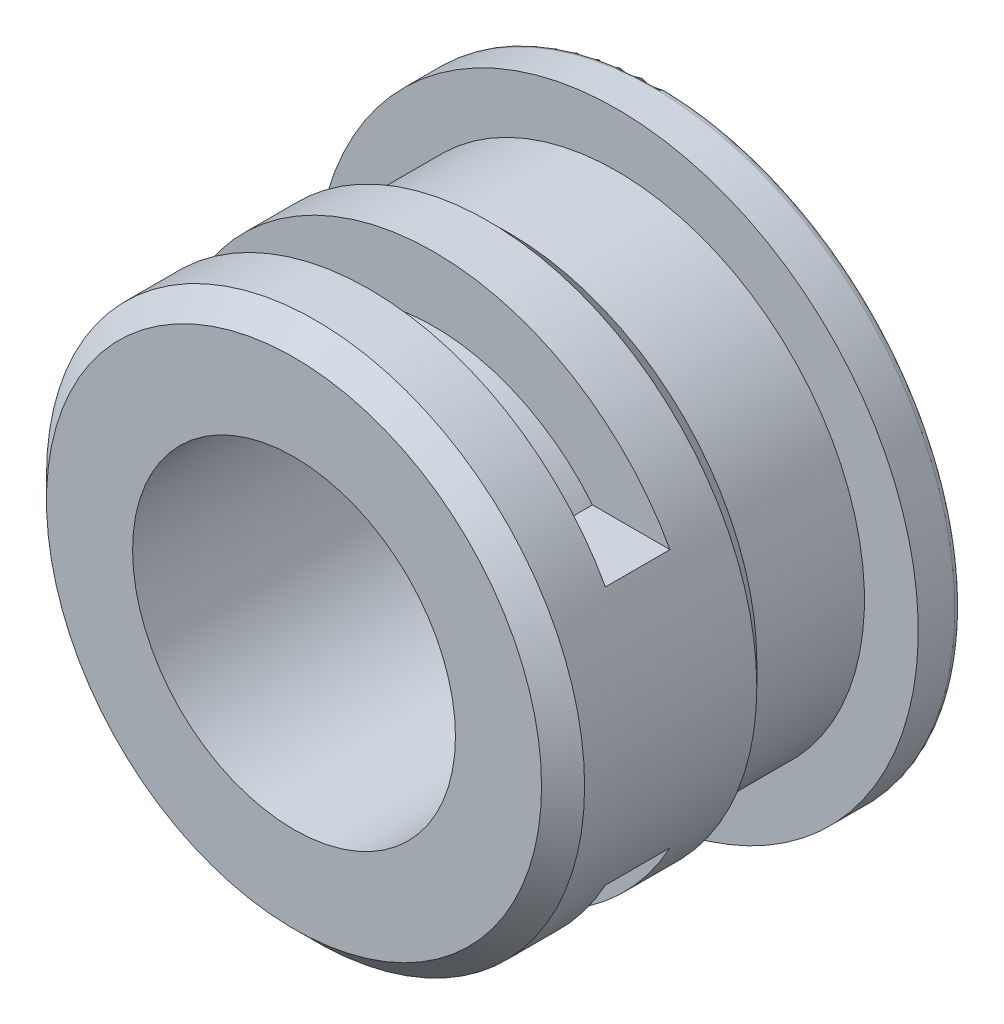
ISO-10303-21;
HEADER;
FILE_DESCRIPTION(('STEP AP214'),'2;1');
FILE_NAME('part.step','',(''),(''),'','','');
FILE_SCHEMA(('AUTOMOTIVE_DESIGN { 1 0 10303 214 1 1 1 1 }'));
ENDSEC;
DATA;
#1=APPLICATION_CONTEXT('core data for automotive mechanical design processes');
#2=APPLICATION_PROTOCOL_DEFINITION('international standard','automotive_design',2000,#1);
#3=PRODUCT_CONTEXT('',#1,'mechanical');
#4=PRODUCT('Part','Part','',(#3));
#5=PRODUCT_RELATED_PRODUCT_CATEGORY('part','',(#4));
#6=PRODUCT_DEFINITION_FORMATION('','',#4);
#7=PRODUCT_DEFINITION_CONTEXT('part definition',#1,'design');
#8=PRODUCT_DEFINITION('design','',#6,#7);
#9=PRODUCT_DEFINITION_SHAPE('','',#8);
#10=(LENGTH_UNIT() NAMED_UNIT(*) SI_UNIT(.MILLI.,.METRE.));
#11=(NAMED_UNIT(*) PLANE_ANGLE_UNIT() SI_UNIT($,.RADIAN.));
#12=(NAMED_UNIT(*) SI_UNIT($,.STERADIAN.) SOLID_ANGLE_UNIT());
#13=UNCERTAINTY_MEASURE_WITH_UNIT(LENGTH_MEASURE(1.E-05),#10,'distance_accuracy_value','');
#14=(GEOMETRIC_REPRESENTATION_CONTEXT(3) GLOBAL_UNCERTAINTY_ASSIGNED_CONTEXT((#13)) GLOBAL_UNIT_ASSIGNED_CONTEXT((#10,
#11,#12)) REPRESENTATION_CONTEXT('',''));
#15=CARTESIAN_POINT('',(0.,0.,0.));
#16=DIRECTION('',(0.,0.,1.));
#17=DIRECTION('',(1.,0.,0.));
#18=AXIS2_PLACEMENT_3D('',#15,#16,#17);
#19=CARTESIAN_POINT('',(0.,0.,-1.));
#20=DIRECTION('',(0.,0.,-1.));
#21=DIRECTION('',(-1.,0.,0.));
#22=AXIS2_PLACEMENT_3D('',#19,#20,#21);
#23=PLANE('',#22);
#24=CARTESIAN_POINT('',(0.,0.,-1.));
#25=DIRECTION('',(0.,0.,-1.));
#26=DIRECTION('',(-1.,0.,0.));
#27=AXIS2_PLACEMENT_3D('',#24,#25,#26);
#28=CIRCLE('',#27,6.85);
#29=CARTESIAN_POINT('',(-6.85,0.,-1.));
#30=VERTEX_POINT('',#29);
#31=EDGE_CURVE('E34',#30,#30,#28,.T.);
#32=ORIENTED_EDGE('',*,*,#31,.T.);
#33=EDGE_LOOP('',(#32));
#34=FACE_BOUND('',#33,.T.);
#35=DIRECTION('',(0.,1.,0.));
#36=VECTOR('',#35,1.);
#37=CARTESIAN_POINT('',(-4.70457326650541,-0.763542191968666,-1.));
#38=LINE('',#37,#36);
#39=CARTESIAN_POINT('',(-4.70457326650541,-0.763542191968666,-1.));
#40=VERTEX_POINT('',#39);
#41=CARTESIAN_POINT('',(-4.70457326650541,-0.205459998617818,-1.));
#42=VERTEX_POINT('',#41);
#43=EDGE_CURVE('E411',#40,#42,#38,.T.);
#44=ORIENTED_EDGE('',*,*,#43,.T.);
#45=DIRECTION('',(-1.,0.,0.));
#46=VECTOR('',#45,1.);
#47=CARTESIAN_POINT('',(-4.70457326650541,-0.205459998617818,-1.));
#48=LINE('',#47,#46);
#49=CARTESIAN_POINT('',(-5.86366705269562,-0.205459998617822,-1.));
#50=VERTEX_POINT('',#49);
#51=EDGE_CURVE('E426',#42,#50,#48,.T.);
#52=ORIENTED_EDGE('',*,*,#51,.T.);
#53=DIRECTION('',(0.,-1.,0.));
#54=VECTOR('',#53,1.);
#55=CARTESIAN_POINT('',(-5.86366705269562,-0.205459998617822,-1.));
#56=LINE('',#55,#54);
#57=CARTESIAN_POINT('',(-5.86366705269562,-0.763542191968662,-1.));
#58=VERTEX_POINT('',#57);
#59=EDGE_CURVE('E433',#50,#58,#56,.T.);
#60=ORIENTED_EDGE('',*,*,#59,.T.);
#61=DIRECTION('',(1.,0.,0.));
#62=VECTOR('',#61,1.);
#63=CARTESIAN_POINT('',(-5.86366705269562,-0.763542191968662,-1.));
#64=LINE('',#63,#62);
#65=EDGE_CURVE('E419',#58,#40,#64,.T.);
#66=ORIENTED_EDGE('',*,*,#65,.T.);
#67=EDGE_LOOP('',(#44,#52,#60,#66));
#68=FACE_BOUND('',#67,.T.);
#69=DIRECTION('',(0.,1.,0.));
#70=VECTOR('',#69,1.);
#71=CARTESIAN_POINT('',(-1.27022130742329,-1.70798898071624,-1.));
#72=LINE('',#71,#70);
#73=CARTESIAN_POINT('',(-1.27022130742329,-1.70798898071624,-1.));
#74=VERTEX_POINT('',#73);
#75=CARTESIAN_POINT('',(-1.27022130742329,1.64050417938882,-1.));
#76=VERTEX_POINT('',#75);
#77=EDGE_CURVE('E441',#74,#76,#72,.T.);
#78=ORIENTED_EDGE('',*,*,#77,.T.);
#79=DIRECTION('',(-1.,0.,0.));
#80=VECTOR('',#79,1.);
#81=CARTESIAN_POINT('',(-1.27022130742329,1.64050417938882,-1.));
#82=LINE('',#81,#80);
#83=CARTESIAN_POINT('',(-1.81153420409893,1.64050417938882,-1.));
#84=VERTEX_POINT('',#83);
#85=EDGE_CURVE('E447',#76,#84,#82,.T.);
#86=ORIENTED_EDGE('',*,*,#85,.T.);
#87=DIRECTION('',(-0.567645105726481,-0.823273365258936,0.));
#88=VECTOR('',#87,1.);
#89=CARTESIAN_POINT('',(-1.81153420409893,1.64050417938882,-1.));
#90=LINE('',#89,#88);
#91=CARTESIAN_POINT('',(-3.33083248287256,-0.562981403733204,-1.));
#92=VERTEX_POINT('',#91);
#93=EDGE_CURVE('E450',#84,#92,#90,.T.);
#94=ORIENTED_EDGE('',*,*,#93,.T.);
#95=DIRECTION('',(0.,1.,0.));
#96=VECTOR('',#95,1.);
#97=CARTESIAN_POINT('',(-3.33083248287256,-0.562981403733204,-1.));
#98=LINE('',#97,#96);
#99=CARTESIAN_POINT('',(-3.33083248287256,1.64050417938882,-1.));
#100=VERTEX_POINT('',#99);
#101=EDGE_CURVE('E453',#92,#100,#98,.T.);
#102=ORIENTED_EDGE('',*,*,#101,.T.);
#103=DIRECTION('',(-1.,0.,0.));
#104=VECTOR('',#103,1.);
#105=CARTESIAN_POINT('',(-3.33083248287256,1.64050417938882,-1.));
#106=LINE('',#105,#104);
#107=CARTESIAN_POINT('',(-3.93184407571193,1.64050417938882,-1.));
#108=VERTEX_POINT('',#107);
#109=EDGE_CURVE('E456',#100,#108,#106,.T.);
#110=ORIENTED_EDGE('',*,*,#109,.T.);
#111=DIRECTION('',(0.,-1.,0.));
#112=VECTOR('',#111,1.);
#113=CARTESIAN_POINT('',(-3.93184407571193,1.64050417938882,-1.));
#114=LINE('',#113,#112);
#115=CARTESIAN_POINT('',(-3.93184407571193,-1.70798898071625,-1.));
#116=VERTEX_POINT('',#115);
#117=EDGE_CURVE('E459',#108,#116,#114,.T.);
#118=ORIENTED_EDGE('',*,*,#117,.T.);
#119=DIRECTION('',(1.,0.,0.));
#120=VECTOR('',#119,1.);
#121=CARTESIAN_POINT('',(-3.93184407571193,-1.70798898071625,-1.));
#122=LINE('',#121,#120);
#123=CARTESIAN_POINT('',(-3.38650654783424,-1.70798898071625,-1.));
#124=VERTEX_POINT('',#123);
#125=EDGE_CURVE('E462',#116,#124,#122,.T.);
#126=ORIENTED_EDGE('',*,*,#125,.T.);
#127=DIRECTION('',(0.567797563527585,0.823168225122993,0.));
#128=VECTOR('',#127,1.);
#129=CARTESIAN_POINT('',(-3.38650654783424,-1.70798898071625,-1.));
#130=LINE('',#129,#128);
#131=CARTESIAN_POINT('',(-1.87123290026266,0.488788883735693,-1.));
#132=VERTEX_POINT('',#131);
#133=EDGE_CURVE('E465',#124,#132,#130,.T.);
#134=ORIENTED_EDGE('',*,*,#133,.T.);
#135=DIRECTION('',(0.,-1.,0.));
#136=VECTOR('',#135,1.);
#137=CARTESIAN_POINT('',(-1.87123290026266,0.488788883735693,-1.));
#138=LINE('',#137,#136);
#139=CARTESIAN_POINT('',(-1.87123290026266,-1.70798898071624,-1.));
#140=VERTEX_POINT('',#139);
#141=EDGE_CURVE('E468',#132,#140,#138,.T.);
#142=ORIENTED_EDGE('',*,*,#141,.T.);
#143=DIRECTION('',(1.,0.,0.));
#144=VECTOR('',#143,1.);
#145=CARTESIAN_POINT('',(-1.87123290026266,-1.70798898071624,-1.));
#146=LINE('',#145,#144);
#147=EDGE_CURVE('E471',#140,#74,#146,.T.);
#148=ORIENTED_EDGE('',*,*,#147,.T.);
#149=EDGE_LOOP('',(#78,#86,#94,#102,#110,#118,#126,#134,#142,#148));
#150=FACE_BOUND('',#149,.T.);
#151=DIRECTION('',(0.,1.,0.));
#152=VECTOR('',#151,1.);
#153=CARTESIAN_POINT('',(0.103519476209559,-1.70798898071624,-1.));
#154=LINE('',#153,#152);
#155=CARTESIAN_POINT('',(0.103519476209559,-1.70798898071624,-1.));
#156=VERTEX_POINT('',#155);
#157=CARTESIAN_POINT('',(0.103519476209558,1.64050417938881,-1.));
#158=VERTEX_POINT('',#157);
#159=EDGE_CURVE('E477',#156,#158,#154,.T.);
#160=ORIENTED_EDGE('',*,*,#159,.T.);
#161=DIRECTION('',(-1.,0.,0.));
#162=VECTOR('',#161,1.);
#163=CARTESIAN_POINT('',(0.103519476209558,1.64050417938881,-1.));
#164=LINE('',#163,#162);
#165=CARTESIAN_POINT('',(-0.497492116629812,1.64050417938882,-1.));
#166=VERTEX_POINT('',#165);
#167=EDGE_CURVE('E497',#158,#166,#164,.T.);
#168=ORIENTED_EDGE('',*,*,#167,.T.);
#169=DIRECTION('',(0.,-1.,0.));
#170=VECTOR('',#169,1.);
#171=CARTESIAN_POINT('',(-0.497492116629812,1.64050417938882,-1.));
#172=LINE('',#171,#170);
#173=CARTESIAN_POINT('',(-0.497492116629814,-1.70798898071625,-1.));
#174=VERTEX_POINT('',#173);
#175=EDGE_CURVE('E500',#166,#174,#172,.T.);
#176=ORIENTED_EDGE('',*,*,#175,.T.);
#177=DIRECTION('',(1.,0.,0.));
#178=VECTOR('',#177,1.);
#179=CARTESIAN_POINT('',(-0.497492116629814,-1.70798898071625,-1.));
#180=LINE('',#179,#178);
#181=EDGE_CURVE('E503',#174,#156,#180,.T.);
#182=ORIENTED_EDGE('',*,*,#181,.T.);
#183=EDGE_LOOP('',(#160,#168,#176,#182));
#184=FACE_BOUND('',#183,.T.);
#185=DIRECTION('',(-0.166512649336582,0.986039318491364,0.));
#186=VECTOR('',#185,1.);
#187=CARTESIAN_POINT('',(4.48231822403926,-1.70798898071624,-1.));
#188=LINE('',#187,#186);
#189=CARTESIAN_POINT('',(4.48231822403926,-1.70798898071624,-1.));
#190=VERTEX_POINT('',#189);
#191=CARTESIAN_POINT('',(3.91685754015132,1.64050417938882,-1.));
#192=VERTEX_POINT('',#191);
#193=EDGE_CURVE('E509',#190,#192,#188,.T.);
#194=ORIENTED_EDGE('',*,*,#193,.T.);
#195=DIRECTION('',(-1.,0.,0.));
#196=VECTOR('',#195,1.);
#197=CARTESIAN_POINT('',(3.91685754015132,1.64050417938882,-1.));
#198=LINE('',#197,#196);
#199=CARTESIAN_POINT('',(3.29303970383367,1.64050417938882,-1.));
#200=VERTEX_POINT('',#199);
#201=EDGE_CURVE('E517',#192,#200,#198,.T.);
#202=ORIENTED_EDGE('',*,*,#201,.T.);
#203=DIRECTION('',(-0.310900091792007,-0.950442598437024,0.));
#204=VECTOR('',#203,1.);
#205=CARTESIAN_POINT('',(3.29303970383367,1.64050417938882,-1.));
#206=LINE('',#205,#204);
#207=CARTESIAN_POINT('',(2.5290305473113,-0.695123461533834,-1.));
#208=VERTEX_POINT('',#207);
#209=EDGE_CURVE('E520',#200,#208,#206,.T.);
#210=ORIENTED_EDGE('',*,*,#209,.T.);
#211=DIRECTION('',(-0.312870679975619,0.949795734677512,0.));
#212=VECTOR('',#211,1.);
#213=CARTESIAN_POINT('',(2.5290305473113,-0.695123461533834,-1.));
#214=LINE('',#213,#212);
#215=CARTESIAN_POINT('',(1.75965521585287,1.64050417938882,-1.));
#216=VERTEX_POINT('',#215);
#217=EDGE_CURVE('E523',#208,#216,#214,.T.);
#218=ORIENTED_EDGE('',*,*,#217,.T.);
#219=DIRECTION('',(-1.,0.,0.));
#220=VECTOR('',#219,1.);
#221=CARTESIAN_POINT('',(1.75965521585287,1.64050417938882,-1.));
#222=LINE('',#221,#220);
#223=CARTESIAN_POINT('',(1.14187432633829,1.64050417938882,-1.));
#224=VERTEX_POINT('',#223);
#225=EDGE_CURVE('E526',#216,#224,#222,.T.);
#226=ORIENTED_EDGE('',*,*,#225,.T.);
#227=DIRECTION('',(-0.166704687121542,-0.98600686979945,0.));
#228=VECTOR('',#227,1.);
#229=CARTESIAN_POINT('',(1.14187432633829,1.64050417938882,-1.));
#230=LINE('',#229,#228);
#231=CARTESIAN_POINT('',(0.575742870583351,-1.70798898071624,-1.));
#232=VERTEX_POINT('',#231);
#233=EDGE_CURVE('E529',#224,#232,#230,.T.);
#234=ORIENTED_EDGE('',*,*,#233,.T.);
#235=DIRECTION('',(1.,0.,0.));
#236=VECTOR('',#235,1.);
#237=CARTESIAN_POINT('',(0.575742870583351,-1.70798898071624,-1.));
#238=LINE('',#237,#236);
#239=CARTESIAN_POINT('',(1.18413295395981,-1.70798898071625,-1.));
#240=VERTEX_POINT('',#239);
#241=EDGE_CURVE('E532',#232,#240,#238,.T.);
#242=ORIENTED_EDGE('',*,*,#241,.T.);
#243=DIRECTION('',(0.166680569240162,0.986010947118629,0.));
#244=VECTOR('',#243,1.);
#245=CARTESIAN_POINT('',(1.18413295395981,-1.70798898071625,-1.));
#246=LINE('',#245,#244);
#247=CARTESIAN_POINT('',(1.54165435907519,0.406954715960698,-1.));
#248=VERTEX_POINT('',#247);
#249=EDGE_CURVE('E535',#240,#248,#246,.T.);
#250=ORIENTED_EDGE('',*,*,#249,.T.);
#251=DIRECTION('',(0.312700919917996,-0.949851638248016,0.));
#252=VECTOR('',#251,1.);
#253=CARTESIAN_POINT('',(1.54165435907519,0.406954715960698,-1.));
#254=LINE('',#253,#252);
#255=CARTESIAN_POINT('',(2.23791555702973,-1.70798898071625,-1.));
#256=VERTEX_POINT('',#255);
#257=EDGE_CURVE('E538',#248,#256,#254,.T.);
#258=ORIENTED_EDGE('',*,*,#257,.T.);
#259=DIRECTION('',(1.,0.,0.));
#260=VECTOR('',#259,1.);
#261=CARTESIAN_POINT('',(2.23791555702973,-1.70798898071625,-1.));
#262=LINE('',#261,#260);
#263=CARTESIAN_POINT('',(2.82417016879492,-1.70798898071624,-1.));
#264=VERTEX_POINT('',#263);
#265=EDGE_CURVE('E541',#256,#264,#262,.T.);
#266=ORIENTED_EDGE('',*,*,#265,.T.);
#267=DIRECTION('',(0.311068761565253,0.950387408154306,0.));
#268=VECTOR('',#267,1.);
#269=CARTESIAN_POINT('',(2.82417016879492,-1.70798898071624,-1.));
#270=LINE('',#269,#268);
#271=CARTESIAN_POINT('',(3.51640673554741,0.406954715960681,-1.));
#272=VERTEX_POINT('',#271);
#273=EDGE_CURVE('E544',#264,#272,#270,.T.);
#274=ORIENTED_EDGE('',*,*,#273,.T.);
#275=DIRECTION('',(0.166376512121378,-0.986062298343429,0.));
#276=VECTOR('',#275,1.);
#277=CARTESIAN_POINT('',(3.51640673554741,0.406954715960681,-1.));
#278=LINE('',#277,#276);
#279=CARTESIAN_POINT('',(3.87325736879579,-1.70798898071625,-1.));
#280=VERTEX_POINT('',#279);
#281=EDGE_CURVE('E547',#272,#280,#278,.T.);
#282=ORIENTED_EDGE('',*,*,#281,.T.);
#283=DIRECTION('',(1.,0.,0.));
#284=VECTOR('',#283,1.);
#285=CARTESIAN_POINT('',(3.87325736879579,-1.70798898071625,-1.));
#286=LINE('',#285,#284);
#287=EDGE_CURVE('E550',#280,#190,#286,.T.);
#288=ORIENTED_EDGE('',*,*,#287,.T.);
#289=EDGE_LOOP('',(#194,#202,#210,#218,#226,#234,#242,#250,#258,#266,#274,#282,#288));
#290=FACE_BOUND('',#289,.T.);
#291=DIRECTION('',(1.,0.,0.));
#292=VECTOR('',#291,1.);
#293=CARTESIAN_POINT('',(4.95454161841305,-0.763542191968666,-1.));
#294=LINE('',#293,#292);
#295=CARTESIAN_POINT('',(4.95454161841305,-0.763542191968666,-1.));
#296=VERTEX_POINT('',#295);
#297=CARTESIAN_POINT('',(6.11363540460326,-0.763542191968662,-1.));
#298=VERTEX_POINT('',#297);
#299=EDGE_CURVE('E588',#296,#298,#294,.T.);
#300=ORIENTED_EDGE('',*,*,#299,.T.);
#301=DIRECTION('',(0.,1.,0.));
#302=VECTOR('',#301,1.);
#303=CARTESIAN_POINT('',(6.11363540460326,-0.763542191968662,-1.));
#304=LINE('',#303,#302);
#305=CARTESIAN_POINT('',(6.11363540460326,-0.205459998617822,-1.));
#306=VERTEX_POINT('',#305);
#307=EDGE_CURVE('E556',#298,#306,#304,.T.);
#308=ORIENTED_EDGE('',*,*,#307,.T.);
#309=DIRECTION('',(-1.,0.,0.));
#310=VECTOR('',#309,1.);
#311=CARTESIAN_POINT('',(6.11363540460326,-0.205459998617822,-1.));
#312=LINE('',#311,#310);
#313=CARTESIAN_POINT('',(4.95454161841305,-0.205459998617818,-1.));
#314=VERTEX_POINT('',#313);
#315=EDGE_CURVE('E582',#306,#314,#312,.T.);
#316=ORIENTED_EDGE('',*,*,#315,.T.);
#317=DIRECTION('',(0.,-1.,0.));
#318=VECTOR('',#317,1.);
#319=CARTESIAN_POINT('',(4.95454161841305,-0.205459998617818,-1.));
#320=LINE('',#319,#318);
#321=EDGE_CURVE('E585',#314,#296,#320,.T.);
#322=ORIENTED_EDGE('',*,*,#321,.T.);
#323=EDGE_LOOP('',(#300,#308,#316,#322));
#324=FACE_BOUND('',#323,.T.);
#325=ADVANCED_FACE('F26',(#34,#68,#150,#184,#290,#324),#23,.T.);
#326=CARTESIAN_POINT('',(0.,0.,7.5));
#327=DIRECTION('',(0.,0.,-1.));
#328=DIRECTION('',(-1.,0.,0.));
#329=AXIS2_PLACEMENT_3D('',#326,#327,#328);
#330=CYLINDRICAL_SURFACE('',#329,6.25);
#331=CARTESIAN_POINT('',(0.,0.,4.25));
#332=DIRECTION('',(0.,0.,1.));
#333=DIRECTION('',(1.,0.,0.));
#334=AXIS2_PLACEMENT_3D('',#331,#332,#333);
#335=CIRCLE('',#334,6.25);
#336=CARTESIAN_POINT('',(5.48292804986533,3.00000000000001,4.24999999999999));
#337=VERTEX_POINT('',#336);
#338=CARTESIAN_POINT('',(-5.48292804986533,3.,4.25));
#339=VERTEX_POINT('',#338);
#340=EDGE_CURVE('E644',#337,#339,#335,.T.);
#341=ORIENTED_EDGE('',*,*,#340,.F.);
#342=DIRECTION('',(0.,0.,1.));
#343=VECTOR('',#342,1.);
#344=CARTESIAN_POINT('',(5.48292804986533,3.00000000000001,4.24999999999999));
#345=LINE('',#344,#343);
#346=CARTESIAN_POINT('',(5.48292804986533,3.00000000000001,5.74999999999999));
#347=VERTEX_POINT('',#346);
#348=EDGE_CURVE('E657',#337,#347,#345,.T.);
#349=ORIENTED_EDGE('',*,*,#348,.T.);
#350=CARTESIAN_POINT('',(0.,0.,5.75));
#351=DIRECTION('',(0.,0.,1.));
#352=DIRECTION('',(1.,0.,0.));
#353=AXIS2_PLACEMENT_3D('',#350,#351,#352);
#354=CIRCLE('',#353,6.25);
#355=CARTESIAN_POINT('',(-5.48292804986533,3.,5.75));
#356=VERTEX_POINT('',#355);
#357=EDGE_CURVE('E625',#347,#356,#354,.T.);
#358=ORIENTED_EDGE('',*,*,#357,.T.);
#359=DIRECTION('',(0.,0.,1.));
#360=VECTOR('',#359,1.);
#361=CARTESIAN_POINT('',(-5.48292804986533,3.,4.25));
#362=LINE('',#361,#360);
#363=EDGE_CURVE('E656',#339,#356,#362,.T.);
#364=ORIENTED_EDGE('',*,*,#363,.F.);
#365=EDGE_LOOP('',(#341,#349,#358,#364));
#366=FACE_BOUND('',#365,.T.);
#367=CARTESIAN_POINT('',(0.,0.,7.));
#368=DIRECTION('',(0.,0.,1.));
#369=DIRECTION('',(1.,0.,0.));
#370=AXIS2_PLACEMENT_3D('',#367,#368,#369);
#371=CIRCLE('',#370,6.25);
#372=CARTESIAN_POINT('',(6.25,0.,7.));
#373=VERTEX_POINT('',#372);
#374=EDGE_CURVE('E687',#373,#373,#371,.F.);
#375=ORIENTED_EDGE('',*,*,#374,.T.);
#376=EDGE_LOOP('',(#375));
#377=FACE_BOUND('',#376,.T.);
#378=CARTESIAN_POINT('',(0.,0.,3.));
#379=DIRECTION('',(0.,0.,1.));
#380=DIRECTION('',(1.,0.,0.));
#381=AXIS2_PLACEMENT_3D('',#378,#379,#380);
#382=CIRCLE('',#381,6.25);
#383=CARTESIAN_POINT('',(6.25,0.,3.));
#384=VERTEX_POINT('',#383);
#385=EDGE_CURVE('E684',#384,#384,#382,.T.);
#386=ORIENTED_EDGE('',*,*,#385,.T.);
#387=EDGE_LOOP('',(#386));
#388=FACE_BOUND('',#387,.T.);
#389=CARTESIAN_POINT('',(0.,0.,4.25));
#390=DIRECTION('',(0.,0.,1.));
#391=DIRECTION('',(1.,0.,0.));
#392=AXIS2_PLACEMENT_3D('',#389,#390,#391);
#393=CIRCLE('',#392,6.25);
#394=CARTESIAN_POINT('',(-5.48292804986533,-3.,4.25));
#395=VERTEX_POINT('',#394);
#396=CARTESIAN_POINT('',(5.48292804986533,-2.99999999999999,4.25));
#397=VERTEX_POINT('',#396);
#398=EDGE_CURVE('E617',#395,#397,#393,.T.);
#399=ORIENTED_EDGE('',*,*,#398,.F.);
#400=DIRECTION('',(0.,0.,1.));
#401=VECTOR('',#400,1.);
#402=CARTESIAN_POINT('',(-5.48292804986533,-3.,4.25));
#403=LINE('',#402,#401);
#404=CARTESIAN_POINT('',(-5.48292804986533,-3.,5.75));
#405=VERTEX_POINT('',#404);
#406=EDGE_CURVE('E629',#395,#405,#403,.T.);
#407=ORIENTED_EDGE('',*,*,#406,.T.);
#408=CARTESIAN_POINT('',(0.,0.,5.75));
#409=DIRECTION('',(0.,0.,1.));
#410=DIRECTION('',(1.,0.,0.));
#411=AXIS2_PLACEMENT_3D('',#408,#409,#410);
#412=CIRCLE('',#411,6.25);
#413=CARTESIAN_POINT('',(5.48292804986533,-2.99999999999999,5.75));
#414=VERTEX_POINT('',#413);
#415=EDGE_CURVE('E605',#405,#414,#412,.T.);
#416=ORIENTED_EDGE('',*,*,#415,.T.);
#417=DIRECTION('',(0.,0.,1.));
#418=VECTOR('',#417,1.);
#419=CARTESIAN_POINT('',(5.48292804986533,-2.99999999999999,4.25));
#420=LINE('',#419,#418);
#421=EDGE_CURVE('E626',#397,#414,#420,.T.);
#422=ORIENTED_EDGE('',*,*,#421,.F.);
#423=EDGE_LOOP('',(#399,#407,#416,#422));
#424=FACE_BOUND('',#423,.T.);
#425=ADVANCED_FACE('F28',(#366,#377,#388,#424),#330,.T.);
#426=CARTESIAN_POINT('',(0.,0.,7.5));
#427=DIRECTION('',(0.,0.,1.));
#428=DIRECTION('',(1.,0.,0.));
#429=AXIS2_PLACEMENT_3D('',#426,#427,#428);
#430=PLANE('',#429);
#431=CARTESIAN_POINT('',(0.,0.,7.5));
#432=DIRECTION('',(0.,0.,1.));
#433=DIRECTION('',(1.,0.,0.));
#434=AXIS2_PLACEMENT_3D('',#431,#432,#433);
#435=CIRCLE('',#434,5.74999999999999);
#436=CARTESIAN_POINT('',(5.74999999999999,0.,7.5));
#437=VERTEX_POINT('',#436);
#438=EDGE_CURVE('E681',#437,#437,#435,.T.);
#439=ORIENTED_EDGE('',*,*,#438,.T.);
#440=EDGE_LOOP('',(#439));
#441=FACE_BOUND('',#440,.T.);
#442=CARTESIAN_POINT('',(0.,0.,7.5));
#443=DIRECTION('',(0.,0.,1.));
#444=DIRECTION('',(1.,0.,0.));
#445=AXIS2_PLACEMENT_3D('',#442,#443,#444);
#446=CIRCLE('',#445,3.75);
#447=CARTESIAN_POINT('',(3.75,0.,7.5));
#448=VERTEX_POINT('',#447);
#449=EDGE_CURVE('E678',#448,#448,#446,.T.);
#450=ORIENTED_EDGE('',*,*,#449,.F.);
#451=EDGE_LOOP('',(#450));
#452=FACE_BOUND('',#451,.T.);
#453=ADVANCED_FACE('F858',(#441,#452),#430,.T.);
#454=CARTESIAN_POINT('',(0.,0.,7.5));
#455=DIRECTION('',(0.,0.,-1.));
#456=DIRECTION('',(-1.,0.,0.));
#457=AXIS2_PLACEMENT_3D('',#454,#455,#456);
#458=CYLINDRICAL_SURFACE('',#457,3.75);
#459=ORIENTED_EDGE('',*,*,#449,.T.);
#460=EDGE_LOOP('',(#459));
#461=FACE_BOUND('',#460,.T.);
#462=CARTESIAN_POINT('',(0.,0.,0.));
#463=DIRECTION('',(0.,0.,1.));
#464=DIRECTION('',(1.,0.,0.));
#465=AXIS2_PLACEMENT_3D('',#462,#463,#464);
#466=CIRCLE('',#465,3.75);
#467=CARTESIAN_POINT('',(3.75,0.,0.));
#468=VERTEX_POINT('',#467);
#469=EDGE_CURVE('E675',#468,#468,#466,.T.);
#470=ORIENTED_EDGE('',*,*,#469,.F.);
#471=EDGE_LOOP('',(#470));
#472=FACE_BOUND('',#471,.T.);
#473=ADVANCED_FACE('F869',(#461,#472),#458,.F.);
#474=CARTESIAN_POINT('',(0.,0.,0.));
#475=DIRECTION('',(0.,0.,-1.));
#476=DIRECTION('',(-1.,0.,0.));
#477=AXIS2_PLACEMENT_3D('',#474,#475,#476);
#478=PLANE('',#477);
#479=ORIENTED_EDGE('',*,*,#469,.T.);
#480=EDGE_LOOP('',(#479));
#481=FACE_BOUND('',#480,.T.);
#482=ADVANCED_FACE('F871',(#481),#478,.F.);
#483=CARTESIAN_POINT('',(0.,0.,0.));
#484=DIRECTION('',(0.,0.,-1.));
#485=DIRECTION('',(-1.,0.,0.));
#486=AXIS2_PLACEMENT_3D('',#483,#484,#485);
#487=CYLINDRICAL_SURFACE('',#486,5.75);
#488=CARTESIAN_POINT('',(0.,0.,0.));
#489=DIRECTION('',(0.,0.,-1.));
#490=DIRECTION('',(-1.,0.,0.));
#491=AXIS2_PLACEMENT_3D('',#488,#489,#490);
#492=CIRCLE('',#491,5.75);
#493=CARTESIAN_POINT('',(-5.75,0.,0.));
#494=VERTEX_POINT('',#493);
#495=EDGE_CURVE('E669',#494,#494,#492,.T.);
#496=ORIENTED_EDGE('',*,*,#495,.F.);
#497=EDGE_LOOP('',(#496));
#498=FACE_BOUND('',#497,.T.);
#499=CARTESIAN_POINT('',(0.,0.,2.5));
#500=DIRECTION('',(0.,0.,-1.));
#501=DIRECTION('',(-1.,0.,0.));
#502=AXIS2_PLACEMENT_3D('',#499,#500,#501);
#503=CIRCLE('',#502,5.75);
#504=CARTESIAN_POINT('',(-5.75,0.,2.5));
#505=VERTEX_POINT('',#504);
#506=EDGE_CURVE('E660',#505,#505,#503,.T.);
#507=ORIENTED_EDGE('',*,*,#506,.T.);
#508=EDGE_LOOP('',(#507));
#509=FACE_BOUND('',#508,.T.);
#510=ADVANCED_FACE('F867',(#498,#509),#487,.T.);
#511=CARTESIAN_POINT('',(0.,0.,-1.));
#512=DIRECTION('',(0.,0.,1.));
#513=DIRECTION('',(1.,0.,0.));
#514=AXIS2_PLACEMENT_3D('',#511,#512,#513);
#515=CYLINDRICAL_SURFACE('',#514,7.);
#516=CARTESIAN_POINT('',(0.,0.,-0.849999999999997));
#517=DIRECTION('',(0.,0.,-1.));
#518=DIRECTION('',(-1.,0.,0.));
#519=AXIS2_PLACEMENT_3D('',#516,#517,#518);
#520=CIRCLE('',#519,7.);
#521=CARTESIAN_POINT('',(-7.,0.,-0.849999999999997));
#522=VERTEX_POINT('',#521);
#523=EDGE_CURVE('E11',#522,#522,#520,.F.);
#524=ORIENTED_EDGE('',*,*,#523,.T.);
#525=EDGE_LOOP('',(#524));
#526=FACE_BOUND('',#525,.T.);
#527=CARTESIAN_POINT('',(0.,0.,0.));
#528=DIRECTION('',(0.,0.,-1.));
#529=DIRECTION('',(-1.,0.,0.));
#530=AXIS2_PLACEMENT_3D('',#527,#528,#529);
#531=CIRCLE('',#530,7.);
#532=CARTESIAN_POINT('',(-7.,0.,0.));
#533=VERTEX_POINT('',#532);
#534=EDGE_CURVE('E672',#533,#533,#531,.T.);
#535=ORIENTED_EDGE('',*,*,#534,.T.);
#536=EDGE_LOOP('',(#535));
#537=FACE_BOUND('',#536,.T.);
#538=ADVANCED_FACE('F864',(#526,#537),#515,.T.);
#539=ORIENTED_EDGE('',*,*,#534,.F.);
#540=EDGE_LOOP('',(#539));
#541=FACE_BOUND('',#540,.T.);
#542=ORIENTED_EDGE('',*,*,#495,.T.);
#543=EDGE_LOOP('',(#542));
#544=FACE_BOUND('',#543,.T.);
#545=ADVANCED_FACE('F862',(#541,#544),#478,.F.);
#546=CARTESIAN_POINT('',(0.,0.,7.5));
#547=DIRECTION('',(0.,0.,-1.));
#548=DIRECTION('',(-1.,0.,0.));
#549=AXIS2_PLACEMENT_3D('',#546,#547,#548);
#550=CONICAL_SURFACE('',#549,5.74999999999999,0.785398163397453);
#551=ORIENTED_EDGE('',*,*,#374,.F.);
#552=EDGE_LOOP('',(#551));
#553=FACE_BOUND('',#552,.T.);
#554=ORIENTED_EDGE('',*,*,#438,.F.);
#555=EDGE_LOOP('',(#554));
#556=FACE_BOUND('',#555,.T.);
#557=ADVANCED_FACE('F889',(#553,#556),#550,.T.);
#558=CARTESIAN_POINT('',(0.,0.,2.5));
#559=DIRECTION('',(0.,0.,1.));
#560=DIRECTION('',(1.,0.,0.));
#561=AXIS2_PLACEMENT_3D('',#558,#559,#560);
#562=CONICAL_SURFACE('',#561,5.74999999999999,0.785398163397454);
#563=ORIENTED_EDGE('',*,*,#385,.F.);
#564=EDGE_LOOP('',(#563));
#565=FACE_BOUND('',#564,.T.);
#566=ORIENTED_EDGE('',*,*,#506,.F.);
#567=EDGE_LOOP('',(#566));
#568=FACE_BOUND('',#567,.T.);
#569=ADVANCED_FACE('F895',(#565,#568),#562,.T.);
#570=CARTESIAN_POINT('',(3.68272996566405,3.,4.25));
#571=DIRECTION('',(0.,-1.,0.));
#572=DIRECTION('',(1.,0.,0.));
#573=AXIS2_PLACEMENT_3D('',#570,#571,#572);
#574=PLANE('',#573);
#575=DIRECTION('',(1.,0.,0.));
#576=VECTOR('',#575,1.);
#577=CARTESIAN_POINT('',(3.68272996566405,3.,5.75));
#578=LINE('',#577,#576);
#579=CARTESIAN_POINT('',(3.68272996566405,3.,5.75));
#580=VERTEX_POINT('',#579);
#581=EDGE_CURVE('E641',#580,#347,#578,.T.);
#582=ORIENTED_EDGE('',*,*,#581,.T.);
#583=ORIENTED_EDGE('',*,*,#348,.F.);
#584=DIRECTION('',(1.,0.,0.));
#585=VECTOR('',#584,1.);
#586=CARTESIAN_POINT('',(3.68272996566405,3.,4.25));
#587=LINE('',#586,#585);
#588=CARTESIAN_POINT('',(3.68272996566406,3.,4.25));
#589=VERTEX_POINT('',#588);
#590=EDGE_CURVE('E653',#589,#337,#587,.T.);
#591=ORIENTED_EDGE('',*,*,#590,.F.);
#592=DIRECTION('',(0.,0.,1.));
#593=VECTOR('',#592,1.);
#594=CARTESIAN_POINT('',(3.68272996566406,3.,4.25));
#595=LINE('',#594,#593);
#596=EDGE_CURVE('E661',#589,#580,#595,.T.);
#597=ORIENTED_EDGE('',*,*,#596,.T.);
#598=EDGE_LOOP('',(#582,#583,#591,#597));
#599=FACE_BOUND('',#598,.T.);
#600=ADVANCED_FACE('F905',(#599),#574,.F.);
#601=CARTESIAN_POINT('',(0.,0.,4.25));
#602=DIRECTION('',(0.,0.,1.));
#603=DIRECTION('',(1.,0.,0.));
#604=AXIS2_PLACEMENT_3D('',#601,#602,#603);
#605=CYLINDRICAL_SURFACE('',#604,4.75);
#606=CARTESIAN_POINT('',(0.,0.,5.75));
#607=DIRECTION('',(0.,0.,-1.));
#608=DIRECTION('',(1.,0.,0.));
#609=AXIS2_PLACEMENT_3D('',#606,#607,#608);
#610=CIRCLE('',#609,4.75);
#611=CARTESIAN_POINT('',(-3.68272996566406,3.00000000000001,5.75));
#612=VERTEX_POINT('',#611);
#613=EDGE_CURVE('E638',#612,#580,#610,.T.);
#614=ORIENTED_EDGE('',*,*,#613,.T.);
#615=ORIENTED_EDGE('',*,*,#596,.F.);
#616=CARTESIAN_POINT('',(0.,0.,4.25));
#617=DIRECTION('',(0.,0.,-1.));
#618=DIRECTION('',(1.,0.,0.));
#619=AXIS2_PLACEMENT_3D('',#616,#617,#618);
#620=CIRCLE('',#619,4.75);
#621=CARTESIAN_POINT('',(-3.68272996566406,3.00000000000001,4.25));
#622=VERTEX_POINT('',#621);
#623=EDGE_CURVE('E650',#622,#589,#620,.T.);
#624=ORIENTED_EDGE('',*,*,#623,.F.);
#625=DIRECTION('',(0.,0.,1.));
#626=VECTOR('',#625,1.);
#627=CARTESIAN_POINT('',(-3.68272996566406,3.00000000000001,4.25));
#628=LINE('',#627,#626);
#629=EDGE_CURVE('E663',#622,#612,#628,.T.);
#630=ORIENTED_EDGE('',*,*,#629,.T.);
#631=EDGE_LOOP('',(#614,#615,#624,#630));
#632=FACE_BOUND('',#631,.T.);
#633=ADVANCED_FACE('F911',(#632),#605,.T.);
#634=CARTESIAN_POINT('',(-5.48292804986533,3.,4.25));
#635=DIRECTION('',(0.,-1.,0.));
#636=DIRECTION('',(1.,0.,0.));
#637=AXIS2_PLACEMENT_3D('',#634,#635,#636);
#638=PLANE('',#637);
#639=DIRECTION('',(1.,0.,0.));
#640=VECTOR('',#639,1.);
#641=CARTESIAN_POINT('',(-5.48292804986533,3.,5.75));
#642=LINE('',#641,#640);
#643=EDGE_CURVE('E635',#356,#612,#642,.T.);
#644=ORIENTED_EDGE('',*,*,#643,.T.);
#645=ORIENTED_EDGE('',*,*,#629,.F.);
#646=DIRECTION('',(1.,0.,0.));
#647=VECTOR('',#646,1.);
#648=CARTESIAN_POINT('',(-5.48292804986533,3.,4.25));
#649=LINE('',#648,#647);
#650=EDGE_CURVE('E647',#339,#622,#649,.T.);
#651=ORIENTED_EDGE('',*,*,#650,.F.);
#652=ORIENTED_EDGE('',*,*,#363,.T.);
#653=EDGE_LOOP('',(#644,#645,#651,#652));
#654=FACE_BOUND('',#653,.T.);
#655=ADVANCED_FACE('F916',(#654),#638,.F.);
#656=CARTESIAN_POINT('',(0.,0.,4.25));
#657=DIRECTION('',(0.,0.,1.));
#658=DIRECTION('',(1.,0.,0.));
#659=AXIS2_PLACEMENT_3D('',#656,#657,#658);
#660=PLANE('',#659);
#661=ORIENTED_EDGE('',*,*,#340,.T.);
#662=ORIENTED_EDGE('',*,*,#650,.T.);
#663=ORIENTED_EDGE('',*,*,#623,.T.);
#664=ORIENTED_EDGE('',*,*,#590,.T.);
#665=EDGE_LOOP('',(#661,#662,#663,#664));
#666=FACE_BOUND('',#665,.T.);
#667=ADVANCED_FACE('F919',(#666),#660,.T.);
#668=CARTESIAN_POINT('',(0.,0.,5.75));
#669=DIRECTION('',(0.,0.,1.));
#670=DIRECTION('',(1.,0.,0.));
#671=AXIS2_PLACEMENT_3D('',#668,#669,#670);
#672=PLANE('',#671);
#673=ORIENTED_EDGE('',*,*,#357,.F.);
#674=ORIENTED_EDGE('',*,*,#581,.F.);
#675=ORIENTED_EDGE('',*,*,#613,.F.);
#676=ORIENTED_EDGE('',*,*,#643,.F.);
#677=EDGE_LOOP('',(#673,#674,#675,#676));
#678=FACE_BOUND('',#677,.T.);
#679=ADVANCED_FACE('F926',(#678),#672,.F.);
#680=CARTESIAN_POINT('',(0.,0.,4.25));
#681=DIRECTION('',(0.,0.,1.));
#682=DIRECTION('',(1.,0.,0.));
#683=AXIS2_PLACEMENT_3D('',#680,#681,#682);
#684=CYLINDRICAL_SURFACE('',#683,4.75);
#685=CARTESIAN_POINT('',(0.,0.,5.75));
#686=DIRECTION('',(0.,0.,-1.));
#687=DIRECTION('',(1.,0.,0.));
#688=AXIS2_PLACEMENT_3D('',#685,#686,#687);
#689=CIRCLE('',#688,4.75);
#690=CARTESIAN_POINT('',(3.68272996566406,-2.99999999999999,5.75));
#691=VERTEX_POINT('',#690);
#692=CARTESIAN_POINT('',(-3.68272996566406,-2.99999999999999,5.75));
#693=VERTEX_POINT('',#692);
#694=EDGE_CURVE('E594',#691,#693,#689,.T.);
#695=ORIENTED_EDGE('',*,*,#694,.T.);
#696=DIRECTION('',(0.,0.,1.));
#697=VECTOR('',#696,1.);
#698=CARTESIAN_POINT('',(-3.68272996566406,-2.99999999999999,4.25));
#699=LINE('',#698,#697);
#700=CARTESIAN_POINT('',(-3.68272996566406,-2.99999999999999,4.25));
#701=VERTEX_POINT('',#700);
#702=EDGE_CURVE('E622',#701,#693,#699,.T.);
#703=ORIENTED_EDGE('',*,*,#702,.F.);
#704=CARTESIAN_POINT('',(0.,0.,4.25));
#705=DIRECTION('',(0.,0.,-1.));
#706=DIRECTION('',(1.,0.,0.));
#707=AXIS2_PLACEMENT_3D('',#704,#705,#706);
#708=CIRCLE('',#707,4.75);
#709=CARTESIAN_POINT('',(3.68272996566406,-2.99999999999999,4.25));
#710=VERTEX_POINT('',#709);
#711=EDGE_CURVE('E611',#710,#701,#708,.T.);
#712=ORIENTED_EDGE('',*,*,#711,.F.);
#713=DIRECTION('',(0.,0.,1.));
#714=VECTOR('',#713,1.);
#715=CARTESIAN_POINT('',(3.68272996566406,-2.99999999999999,4.25));
#716=LINE('',#715,#714);
#717=EDGE_CURVE('E623',#710,#691,#716,.T.);
#718=ORIENTED_EDGE('',*,*,#717,.T.);
#719=EDGE_LOOP('',(#695,#703,#712,#718));
#720=FACE_BOUND('',#719,.T.);
#721=ADVANCED_FACE('F930',(#720),#684,.T.);
#722=CARTESIAN_POINT('',(3.68272996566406,-2.99999999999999,4.25));
#723=DIRECTION('',(0.,1.,0.));
#724=DIRECTION('',(-1.,0.,0.));
#725=AXIS2_PLACEMENT_3D('',#722,#723,#724);
#726=PLANE('',#725);
#727=DIRECTION('',(-1.,0.,0.));
#728=VECTOR('',#727,1.);
#729=CARTESIAN_POINT('',(3.68272996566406,-2.99999999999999,5.75));
#730=LINE('',#729,#728);
#731=EDGE_CURVE('E608',#414,#691,#730,.T.);
#732=ORIENTED_EDGE('',*,*,#731,.T.);
#733=ORIENTED_EDGE('',*,*,#717,.F.);
#734=DIRECTION('',(-1.,0.,0.));
#735=VECTOR('',#734,1.);
#736=CARTESIAN_POINT('',(3.68272996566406,-2.99999999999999,4.25));
#737=LINE('',#736,#735);
#738=EDGE_CURVE('E619',#397,#710,#737,.T.);
#739=ORIENTED_EDGE('',*,*,#738,.F.);
#740=ORIENTED_EDGE('',*,*,#421,.T.);
#741=EDGE_LOOP('',(#732,#733,#739,#740));
#742=FACE_BOUND('',#741,.T.);
#743=ADVANCED_FACE('F934',(#742),#726,.F.);
#744=CARTESIAN_POINT('',(-5.48292804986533,-3.,4.25));
#745=DIRECTION('',(0.,1.,0.));
#746=DIRECTION('',(0.,0.,1.));
#747=AXIS2_PLACEMENT_3D('',#744,#745,#746);
#748=PLANE('',#747);
#749=DIRECTION('',(-1.,0.,0.));
#750=VECTOR('',#749,1.);
#751=CARTESIAN_POINT('',(-5.48292804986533,-3.,5.75));
#752=LINE('',#751,#750);
#753=EDGE_CURVE('E602',#693,#405,#752,.T.);
#754=ORIENTED_EDGE('',*,*,#753,.T.);
#755=ORIENTED_EDGE('',*,*,#406,.F.);
#756=DIRECTION('',(-1.,0.,0.));
#757=VECTOR('',#756,1.);
#758=CARTESIAN_POINT('',(-5.48292804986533,-3.,4.25));
#759=LINE('',#758,#757);
#760=EDGE_CURVE('E614',#701,#395,#759,.T.);
#761=ORIENTED_EDGE('',*,*,#760,.F.);
#762=ORIENTED_EDGE('',*,*,#702,.T.);
#763=EDGE_LOOP('',(#754,#755,#761,#762));
#764=FACE_BOUND('',#763,.T.);
#765=ADVANCED_FACE('F936',(#764),#748,.F.);
#766=CARTESIAN_POINT('',(0.,0.,4.25));
#767=DIRECTION('',(0.,0.,1.));
#768=DIRECTION('',(1.,0.,0.));
#769=AXIS2_PLACEMENT_3D('',#766,#767,#768);
#770=PLANE('',#769);
#771=ORIENTED_EDGE('',*,*,#711,.T.);
#772=ORIENTED_EDGE('',*,*,#760,.T.);
#773=ORIENTED_EDGE('',*,*,#398,.T.);
#774=ORIENTED_EDGE('',*,*,#738,.T.);
#775=EDGE_LOOP('',(#771,#772,#773,#774));
#776=FACE_BOUND('',#775,.T.);
#777=ADVANCED_FACE('F939',(#776),#770,.T.);
#778=CARTESIAN_POINT('',(0.,0.,5.75));
#779=DIRECTION('',(0.,0.,1.));
#780=DIRECTION('',(1.,0.,0.));
#781=AXIS2_PLACEMENT_3D('',#778,#779,#780);
#782=PLANE('',#781);
#783=ORIENTED_EDGE('',*,*,#694,.F.);
#784=ORIENTED_EDGE('',*,*,#731,.F.);
#785=ORIENTED_EDGE('',*,*,#415,.F.);
#786=ORIENTED_EDGE('',*,*,#753,.F.);
#787=EDGE_LOOP('',(#783,#784,#785,#786));
#788=FACE_BOUND('',#787,.T.);
#789=ADVANCED_FACE('F946',(#788),#782,.F.);
#790=CARTESIAN_POINT('',(6.11363540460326,-0.763542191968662,-1.3));
#791=DIRECTION('',(1.,0.,0.));
#792=DIRECTION('',(0.,0.,-1.));
#793=AXIS2_PLACEMENT_3D('',#790,#791,#792);
#794=PLANE('',#793);
#795=DIRECTION('',(0.,0.,1.));
#796=VECTOR('',#795,1.);
#797=CARTESIAN_POINT('',(6.11363540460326,-0.763542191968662,-1.3));
#798=LINE('',#797,#796);
#799=CARTESIAN_POINT('',(6.11363540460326,-0.763542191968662,-1.15));
#800=VERTEX_POINT('',#799);
#801=EDGE_CURVE('E592',#800,#298,#798,.T.);
#802=ORIENTED_EDGE('',*,*,#801,.F.);
#803=DIRECTION('',(0.,1.,0.));
#804=VECTOR('',#803,1.);
#805=CARTESIAN_POINT('',(6.11363540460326,-0.763542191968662,-1.15));
#806=LINE('',#805,#804);
#807=CARTESIAN_POINT('',(6.11363540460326,-0.205459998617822,-1.15));
#808=VERTEX_POINT('',#807);
#809=EDGE_CURVE('E722',#800,#808,#806,.T.);
#810=ORIENTED_EDGE('',*,*,#809,.T.);
#811=DIRECTION('',(0.,0.,1.));
#812=VECTOR('',#811,1.);
#813=CARTESIAN_POINT('',(6.11363540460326,-0.205459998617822,-1.3));
#814=LINE('',#813,#812);
#815=EDGE_CURVE('E591',#808,#306,#814,.T.);
#816=ORIENTED_EDGE('',*,*,#815,.T.);
#817=ORIENTED_EDGE('',*,*,#307,.F.);
#818=EDGE_LOOP('',(#802,#810,#816,#817));
#819=FACE_BOUND('',#818,.T.);
#820=ADVANCED_FACE('F949',(#819),#794,.T.);
#821=CARTESIAN_POINT('',(4.95454161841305,-0.763542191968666,-1.3));
#822=DIRECTION('',(0.,-1.,0.));
#823=DIRECTION('',(0.,0.,-1.));
#824=AXIS2_PLACEMENT_3D('',#821,#822,#823);
#825=PLANE('',#824);
#826=DIRECTION('',(0.,0.,1.));
#827=VECTOR('',#826,1.);
#828=CARTESIAN_POINT('',(4.95454161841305,-0.763542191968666,-1.3));
#829=LINE('',#828,#827);
#830=CARTESIAN_POINT('',(4.95454161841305,-0.763542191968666,-1.15));
#831=VERTEX_POINT('',#830);
#832=EDGE_CURVE('E595',#831,#296,#829,.T.);
#833=ORIENTED_EDGE('',*,*,#832,.F.);
#834=DIRECTION('',(1.,0.,0.));
#835=VECTOR('',#834,1.);
#836=CARTESIAN_POINT('',(4.95454161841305,-0.763542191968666,-1.15));
#837=LINE('',#836,#835);
#838=EDGE_CURVE('E720',#831,#800,#837,.T.);
#839=ORIENTED_EDGE('',*,*,#838,.T.);
#840=ORIENTED_EDGE('',*,*,#801,.T.);
#841=ORIENTED_EDGE('',*,*,#299,.F.);
#842=EDGE_LOOP('',(#833,#839,#840,#841));
#843=FACE_BOUND('',#842,.T.);
#844=ADVANCED_FACE('F952',(#843),#825,.T.);
#845=CARTESIAN_POINT('',(4.95454161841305,-0.205459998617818,-1.3));
#846=DIRECTION('',(-1.,0.,0.));
#847=DIRECTION('',(0.,0.,1.));
#848=AXIS2_PLACEMENT_3D('',#845,#846,#847);
#849=PLANE('',#848);
#850=DIRECTION('',(0.,0.,1.));
#851=VECTOR('',#850,1.);
#852=CARTESIAN_POINT('',(4.95454161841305,-0.205459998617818,-1.3));
#853=LINE('',#852,#851);
#854=CARTESIAN_POINT('',(4.95454161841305,-0.205459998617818,-1.15));
#855=VERTEX_POINT('',#854);
#856=EDGE_CURVE('E597',#855,#314,#853,.T.);
#857=ORIENTED_EDGE('',*,*,#856,.F.);
#858=DIRECTION('',(0.,-1.,0.));
#859=VECTOR('',#858,1.);
#860=CARTESIAN_POINT('',(4.95454161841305,-0.205459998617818,-1.15));
#861=LINE('',#860,#859);
#862=EDGE_CURVE('E718',#855,#831,#861,.T.);
#863=ORIENTED_EDGE('',*,*,#862,.T.);
#864=ORIENTED_EDGE('',*,*,#832,.T.);
#865=ORIENTED_EDGE('',*,*,#321,.F.);
#866=EDGE_LOOP('',(#857,#863,#864,#865));
#867=FACE_BOUND('',#866,.T.);
#868=ADVANCED_FACE('F958',(#867),#849,.T.);
#869=CARTESIAN_POINT('',(6.11363540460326,-0.205459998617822,-1.3));
#870=DIRECTION('',(0.,1.,0.));
#871=DIRECTION('',(0.,0.,1.));
#872=AXIS2_PLACEMENT_3D('',#869,#870,#871);
#873=PLANE('',#872);
#874=ORIENTED_EDGE('',*,*,#815,.F.);
#875=DIRECTION('',(-1.,0.,0.));
#876=VECTOR('',#875,1.);
#877=CARTESIAN_POINT('',(6.11363540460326,-0.205459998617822,-1.15));
#878=LINE('',#877,#876);
#879=EDGE_CURVE('E706',#808,#855,#878,.T.);
#880=ORIENTED_EDGE('',*,*,#879,.T.);
#881=ORIENTED_EDGE('',*,*,#856,.T.);
#882=ORIENTED_EDGE('',*,*,#315,.F.);
#883=EDGE_LOOP('',(#874,#880,#881,#882));
#884=FACE_BOUND('',#883,.T.);
#885=ADVANCED_FACE('F954',(#884),#873,.T.);
#886=CARTESIAN_POINT('',(6.11363540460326,-0.205459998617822,-1.3));
#887=DIRECTION('',(0.,0.,1.));
#888=DIRECTION('',(1.,0.,0.));
#889=AXIS2_PLACEMENT_3D('',#886,#887,#888);
#890=PLANE('',#889);
#891=DIRECTION('',(0.,-1.,0.));
#892=VECTOR('',#891,1.);
#893=CARTESIAN_POINT('',(5.10454161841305,-0.205459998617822,-1.3));
#894=LINE('',#893,#892);
#895=CARTESIAN_POINT('',(5.10454161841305,-0.613542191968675,-1.3));
#896=VERTEX_POINT('',#895);
#897=CARTESIAN_POINT('',(5.10454161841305,-0.355459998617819,-1.3));
#898=VERTEX_POINT('',#897);
#899=EDGE_CURVE('E713',#896,#898,#894,.F.);
#900=ORIENTED_EDGE('',*,*,#899,.T.);
#901=DIRECTION('',(-1.,0.,0.));
#902=VECTOR('',#901,1.);
#903=CARTESIAN_POINT('',(6.11363540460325,-0.355459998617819,-1.3));
#904=LINE('',#903,#902);
#905=CARTESIAN_POINT('',(5.96363540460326,-0.35545999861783,-1.3));
#906=VERTEX_POINT('',#905);
#907=EDGE_CURVE('E715',#898,#906,#904,.F.);
#908=ORIENTED_EDGE('',*,*,#907,.T.);
#909=DIRECTION('',(0.,1.,0.));
#910=VECTOR('',#909,1.);
#911=CARTESIAN_POINT('',(5.96363540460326,-0.763542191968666,-1.3));
#912=LINE('',#911,#910);
#913=CARTESIAN_POINT('',(5.96363540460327,-0.613542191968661,-1.3));
#914=VERTEX_POINT('',#913);
#915=EDGE_CURVE('E709',#906,#914,#912,.F.);
#916=ORIENTED_EDGE('',*,*,#915,.T.);
#917=DIRECTION('',(1.,0.,0.));
#918=VECTOR('',#917,1.);
#919=CARTESIAN_POINT('',(4.95454161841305,-0.613542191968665,-1.3));
#920=LINE('',#919,#918);
#921=EDGE_CURVE('E711',#914,#896,#920,.F.);
#922=ORIENTED_EDGE('',*,*,#921,.T.);
#923=EDGE_LOOP('',(#900,#908,#916,#922));
#924=FACE_BOUND('',#923,.T.);
#925=ADVANCED_FACE('F957',(#924),#890,.F.);
#926=CARTESIAN_POINT('',(4.48231822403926,-1.70798898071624,-1.3));
#927=DIRECTION('',(0.986039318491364,0.166512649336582,0.));
#928=DIRECTION('',(-0.166512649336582,0.986039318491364,0.));
#929=AXIS2_PLACEMENT_3D('',#926,#927,#928);
#930=PLANE('',#929);
#931=DIRECTION('',(0.,0.,1.));
#932=VECTOR('',#931,1.);
#933=CARTESIAN_POINT('',(4.48231822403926,-1.70798898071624,-1.3));
#934=LINE('',#933,#932);
#935=CARTESIAN_POINT('',(4.48231822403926,-1.70798898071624,-1.15));
#936=VERTEX_POINT('',#935);
#937=EDGE_CURVE('E554',#936,#190,#934,.T.);
#938=ORIENTED_EDGE('',*,*,#937,.F.);
#939=DIRECTION('',(-0.166512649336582,0.986039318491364,0.));
#940=VECTOR('',#939,1.);
#941=CARTESIAN_POINT('',(4.48231822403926,-1.70798898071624,-1.15));
#942=LINE('',#941,#940);
#943=CARTESIAN_POINT('',(3.91685754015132,1.64050417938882,-1.15));
#944=VERTEX_POINT('',#943);
#945=EDGE_CURVE('E776',#936,#944,#942,.T.);
#946=ORIENTED_EDGE('',*,*,#945,.T.);
#947=DIRECTION('',(0.,0.,1.));
#948=VECTOR('',#947,1.);
#949=CARTESIAN_POINT('',(3.91685754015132,1.64050417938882,-1.3));
#950=LINE('',#949,#948);
#951=EDGE_CURVE('E553',#944,#192,#950,.T.);
#952=ORIENTED_EDGE('',*,*,#951,.T.);
#953=ORIENTED_EDGE('',*,*,#193,.F.);
#954=EDGE_LOOP('',(#938,#946,#952,#953));
#955=FACE_BOUND('',#954,.T.);
#956=ADVANCED_FACE('F968',(#955),#930,.T.);
#957=CARTESIAN_POINT('',(3.87325736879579,-1.70798898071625,-1.3));
#958=DIRECTION('',(0.,-1.,0.));
#959=DIRECTION('',(0.,0.,-1.));
#960=AXIS2_PLACEMENT_3D('',#957,#958,#959);
#961=PLANE('',#960);
#962=DIRECTION('',(0.,0.,1.));
#963=VECTOR('',#962,1.);
#964=CARTESIAN_POINT('',(3.87325736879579,-1.70798898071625,-1.3));
#965=LINE('',#964,#963);
#966=CARTESIAN_POINT('',(3.87325736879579,-1.70798898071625,-1.15));
#967=VERTEX_POINT('',#966);
#968=EDGE_CURVE('E557',#967,#280,#965,.T.);
#969=ORIENTED_EDGE('',*,*,#968,.F.);
#970=DIRECTION('',(1.,0.,0.));
#971=VECTOR('',#970,1.);
#972=CARTESIAN_POINT('',(3.87325736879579,-1.70798898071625,-1.15));
#973=LINE('',#972,#971);
#974=EDGE_CURVE('E774',#967,#936,#973,.T.);
#975=ORIENTED_EDGE('',*,*,#974,.T.);
#976=ORIENTED_EDGE('',*,*,#937,.T.);
#977=ORIENTED_EDGE('',*,*,#287,.F.);
#978=EDGE_LOOP('',(#969,#975,#976,#977));
#979=FACE_BOUND('',#978,.T.);
#980=ADVANCED_FACE('F972',(#979),#961,.T.);
#981=CARTESIAN_POINT('',(3.51640673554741,0.406954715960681,-1.3));
#982=DIRECTION('',(-0.986062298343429,-0.166376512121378,0.));
#983=DIRECTION('',(0.166376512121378,-0.986062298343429,0.));
#984=AXIS2_PLACEMENT_3D('',#981,#982,#983);
#985=PLANE('',#984);
#986=DIRECTION('',(0.,0.,1.));
#987=VECTOR('',#986,1.);
#988=CARTESIAN_POINT('',(3.51640673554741,0.406954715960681,-1.3));
#989=LINE('',#988,#987);
#990=CARTESIAN_POINT('',(3.51640673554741,0.406954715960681,-1.15));
#991=VERTEX_POINT('',#990);
#992=EDGE_CURVE('E559',#991,#272,#989,.T.);
#993=ORIENTED_EDGE('',*,*,#992,.F.);
#994=DIRECTION('',(0.166376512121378,-0.986062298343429,0.));
#995=VECTOR('',#994,1.);
#996=CARTESIAN_POINT('',(3.51640673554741,0.406954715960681,-1.15));
#997=LINE('',#996,#995);
#998=EDGE_CURVE('E772',#991,#967,#997,.T.);
#999=ORIENTED_EDGE('',*,*,#998,.T.);
#1000=ORIENTED_EDGE('',*,*,#968,.T.);
#1001=ORIENTED_EDGE('',*,*,#281,.F.);
#1002=EDGE_LOOP('',(#993,#999,#1000,#1001));
#1003=FACE_BOUND('',#1002,.T.);
#1004=ADVANCED_FACE('F1014',(#1003),#985,.T.);
#1005=CARTESIAN_POINT('',(2.82417016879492,-1.70798898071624,-1.3));
#1006=DIRECTION('',(0.950387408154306,-0.311068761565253,0.));
#1007=DIRECTION('',(0.311068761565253,0.950387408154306,0.));
#1008=AXIS2_PLACEMENT_3D('',#1005,#1006,#1007);
#1009=PLANE('',#1008);
#1010=DIRECTION('',(0.,0.,1.));
#1011=VECTOR('',#1010,1.);
#1012=CARTESIAN_POINT('',(2.82417016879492,-1.70798898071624,-1.3));
#1013=LINE('',#1012,#1011);
#1014=CARTESIAN_POINT('',(2.82417016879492,-1.70798898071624,-1.15));
#1015=VERTEX_POINT('',#1014);
#1016=EDGE_CURVE('E561',#1015,#264,#1013,.T.);
#1017=ORIENTED_EDGE('',*,*,#1016,.F.);
#1018=DIRECTION('',(0.311068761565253,0.950387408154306,0.));
#1019=VECTOR('',#1018,1.);
#1020=CARTESIAN_POINT('',(2.82417016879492,-1.70798898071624,-1.15));
#1021=LINE('',#1020,#1019);
#1022=EDGE_CURVE('E770',#1015,#991,#1021,.T.);
#1023=ORIENTED_EDGE('',*,*,#1022,.T.);
#1024=ORIENTED_EDGE('',*,*,#992,.T.);
#1025=ORIENTED_EDGE('',*,*,#273,.F.);
#1026=EDGE_LOOP('',(#1017,#1023,#1024,#1025));
#1027=FACE_BOUND('',#1026,.T.);
#1028=ADVANCED_FACE('F1010',(#1027),#1009,.T.);
#1029=CARTESIAN_POINT('',(2.23791555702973,-1.70798898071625,-1.3));
#1030=DIRECTION('',(0.,-1.,0.));
#1031=DIRECTION('',(0.,0.,-1.));
#1032=AXIS2_PLACEMENT_3D('',#1029,#1030,#1031);
#1033=PLANE('',#1032);
#1034=DIRECTION('',(0.,0.,1.));
#1035=VECTOR('',#1034,1.);
#1036=CARTESIAN_POINT('',(2.23791555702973,-1.70798898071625,-1.3));
#1037=LINE('',#1036,#1035);
#1038=CARTESIAN_POINT('',(2.23791555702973,-1.70798898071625,-1.15));
#1039=VERTEX_POINT('',#1038);
#1040=EDGE_CURVE('E563',#1039,#256,#1037,.T.);
#1041=ORIENTED_EDGE('',*,*,#1040,.F.);
#1042=DIRECTION('',(1.,0.,0.));
#1043=VECTOR('',#1042,1.);
#1044=CARTESIAN_POINT('',(2.23791555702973,-1.70798898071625,-1.15));
#1045=LINE('',#1044,#1043);
#1046=EDGE_CURVE('E768',#1039,#1015,#1045,.T.);
#1047=ORIENTED_EDGE('',*,*,#1046,.T.);
#1048=ORIENTED_EDGE('',*,*,#1016,.T.);
#1049=ORIENTED_EDGE('',*,*,#265,.F.);
#1050=EDGE_LOOP('',(#1041,#1047,#1048,#1049));
#1051=FACE_BOUND('',#1050,.T.);
#1052=ADVANCED_FACE('F1006',(#1051),#1033,.T.);
#1053=CARTESIAN_POINT('',(1.54165435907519,0.406954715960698,-1.3));
#1054=DIRECTION('',(-0.949851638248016,-0.312700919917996,0.));
#1055=DIRECTION('',(0.312700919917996,-0.949851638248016,0.));
#1056=AXIS2_PLACEMENT_3D('',#1053,#1054,#1055);
#1057=PLANE('',#1056);
#1058=DIRECTION('',(0.,0.,1.));
#1059=VECTOR('',#1058,1.);
#1060=CARTESIAN_POINT('',(1.54165435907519,0.406954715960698,-1.3));
#1061=LINE('',#1060,#1059);
#1062=CARTESIAN_POINT('',(1.54165435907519,0.406954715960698,-1.15));
#1063=VERTEX_POINT('',#1062);
#1064=EDGE_CURVE('E565',#1063,#248,#1061,.T.);
#1065=ORIENTED_EDGE('',*,*,#1064,.F.);
#1066=DIRECTION('',(0.312700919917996,-0.949851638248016,0.));
#1067=VECTOR('',#1066,1.);
#1068=CARTESIAN_POINT('',(1.54165435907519,0.406954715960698,-1.15));
#1069=LINE('',#1068,#1067);
#1070=EDGE_CURVE('E766',#1063,#1039,#1069,.T.);
#1071=ORIENTED_EDGE('',*,*,#1070,.T.);
#1072=ORIENTED_EDGE('',*,*,#1040,.T.);
#1073=ORIENTED_EDGE('',*,*,#257,.F.);
#1074=EDGE_LOOP('',(#1065,#1071,#1072,#1073));
#1075=FACE_BOUND('',#1074,.T.);
#1076=ADVANCED_FACE('F1002',(#1075),#1057,.T.);
#1077=CARTESIAN_POINT('',(1.18413295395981,-1.70798898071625,-1.3));
#1078=DIRECTION('',(0.986010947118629,-0.166680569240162,0.));
#1079=DIRECTION('',(0.166680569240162,0.986010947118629,0.));
#1080=AXIS2_PLACEMENT_3D('',#1077,#1078,#1079);
#1081=PLANE('',#1080);
#1082=DIRECTION('',(0.,0.,1.));
#1083=VECTOR('',#1082,1.);
#1084=CARTESIAN_POINT('',(1.18413295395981,-1.70798898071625,-1.3));
#1085=LINE('',#1084,#1083);
#1086=CARTESIAN_POINT('',(1.18413295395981,-1.70798898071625,-1.15));
#1087=VERTEX_POINT('',#1086);
#1088=EDGE_CURVE('E567',#1087,#240,#1085,.T.);
#1089=ORIENTED_EDGE('',*,*,#1088,.F.);
#1090=DIRECTION('',(0.166680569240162,0.986010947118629,0.));
#1091=VECTOR('',#1090,1.);
#1092=CARTESIAN_POINT('',(1.18413295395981,-1.70798898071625,-1.15));
#1093=LINE('',#1092,#1091);
#1094=EDGE_CURVE('E764',#1087,#1063,#1093,.T.);
#1095=ORIENTED_EDGE('',*,*,#1094,.T.);
#1096=ORIENTED_EDGE('',*,*,#1064,.T.);
#1097=ORIENTED_EDGE('',*,*,#249,.F.);
#1098=EDGE_LOOP('',(#1089,#1095,#1096,#1097));
#1099=FACE_BOUND('',#1098,.T.);
#1100=ADVANCED_FACE('F998',(#1099),#1081,.T.);
#1101=CARTESIAN_POINT('',(0.575742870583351,-1.70798898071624,-1.3));
#1102=DIRECTION('',(0.,-1.,0.));
#1103=DIRECTION('',(0.,0.,-1.));
#1104=AXIS2_PLACEMENT_3D('',#1101,#1102,#1103);
#1105=PLANE('',#1104);
#1106=DIRECTION('',(0.,0.,1.));
#1107=VECTOR('',#1106,1.);
#1108=CARTESIAN_POINT('',(0.575742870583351,-1.70798898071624,-1.3));
#1109=LINE('',#1108,#1107);
#1110=CARTESIAN_POINT('',(0.575742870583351,-1.70798898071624,-1.15));
#1111=VERTEX_POINT('',#1110);
#1112=EDGE_CURVE('E569',#1111,#232,#1109,.T.);
#1113=ORIENTED_EDGE('',*,*,#1112,.F.);
#1114=DIRECTION('',(1.,0.,0.));
#1115=VECTOR('',#1114,1.);
#1116=CARTESIAN_POINT('',(0.575742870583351,-1.70798898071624,-1.15));
#1117=LINE('',#1116,#1115);
#1118=EDGE_CURVE('E762',#1111,#1087,#1117,.T.);
#1119=ORIENTED_EDGE('',*,*,#1118,.T.);
#1120=ORIENTED_EDGE('',*,*,#1088,.T.);
#1121=ORIENTED_EDGE('',*,*,#241,.F.);
#1122=EDGE_LOOP('',(#1113,#1119,#1120,#1121));
#1123=FACE_BOUND('',#1122,.T.);
#1124=ADVANCED_FACE('F994',(#1123),#1105,.T.);
#1125=CARTESIAN_POINT('',(1.14187432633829,1.64050417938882,-1.3));
#1126=DIRECTION('',(-0.98600686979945,0.166704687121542,0.));
#1127=DIRECTION('',(-0.166704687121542,-0.98600686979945,0.));
#1128=AXIS2_PLACEMENT_3D('',#1125,#1126,#1127);
#1129=PLANE('',#1128);
#1130=DIRECTION('',(0.,0.,1.));
#1131=VECTOR('',#1130,1.);
#1132=CARTESIAN_POINT('',(1.14187432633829,1.64050417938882,-1.3));
#1133=LINE('',#1132,#1131);
#1134=CARTESIAN_POINT('',(1.14187432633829,1.64050417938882,-1.15));
#1135=VERTEX_POINT('',#1134);
#1136=EDGE_CURVE('E571',#1135,#224,#1133,.T.);
#1137=ORIENTED_EDGE('',*,*,#1136,.F.);
#1138=DIRECTION('',(-0.166704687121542,-0.98600686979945,0.));
#1139=VECTOR('',#1138,1.);
#1140=CARTESIAN_POINT('',(1.14187432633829,1.64050417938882,-1.15));
#1141=LINE('',#1140,#1139);
#1142=EDGE_CURVE('E760',#1135,#1111,#1141,.T.);
#1143=ORIENTED_EDGE('',*,*,#1142,.T.);
#1144=ORIENTED_EDGE('',*,*,#1112,.T.);
#1145=ORIENTED_EDGE('',*,*,#233,.F.);
#1146=EDGE_LOOP('',(#1137,#1143,#1144,#1145));
#1147=FACE_BOUND('',#1146,.T.);
#1148=ADVANCED_FACE('F990',(#1147),#1129,.T.);
#1149=CARTESIAN_POINT('',(1.75965521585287,1.64050417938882,-1.3));
#1150=DIRECTION('',(0.,1.,0.));
#1151=DIRECTION('',(0.,0.,1.));
#1152=AXIS2_PLACEMENT_3D('',#1149,#1150,#1151);
#1153=PLANE('',#1152);
#1154=DIRECTION('',(0.,0.,1.));
#1155=VECTOR('',#1154,1.);
#1156=CARTESIAN_POINT('',(1.75965521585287,1.64050417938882,-1.3));
#1157=LINE('',#1156,#1155);
#1158=CARTESIAN_POINT('',(1.75965521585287,1.64050417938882,-1.15));
#1159=VERTEX_POINT('',#1158);
#1160=EDGE_CURVE('E573',#1159,#216,#1157,.T.);
#1161=ORIENTED_EDGE('',*,*,#1160,.F.);
#1162=DIRECTION('',(-1.,0.,0.));
#1163=VECTOR('',#1162,1.);
#1164=CARTESIAN_POINT('',(1.75965521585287,1.64050417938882,-1.15));
#1165=LINE('',#1164,#1163);
#1166=EDGE_CURVE('E758',#1159,#1135,#1165,.T.);
#1167=ORIENTED_EDGE('',*,*,#1166,.T.);
#1168=ORIENTED_EDGE('',*,*,#1136,.T.);
#1169=ORIENTED_EDGE('',*,*,#225,.F.);
#1170=EDGE_LOOP('',(#1161,#1167,#1168,#1169));
#1171=FACE_BOUND('',#1170,.T.);
#1172=ADVANCED_FACE('F986',(#1171),#1153,.T.);
#1173=CARTESIAN_POINT('',(2.5290305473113,-0.695123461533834,-1.3));
#1174=DIRECTION('',(0.949795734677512,0.312870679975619,0.));
#1175=DIRECTION('',(-0.312870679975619,0.949795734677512,0.));
#1176=AXIS2_PLACEMENT_3D('',#1173,#1174,#1175);
#1177=PLANE('',#1176);
#1178=DIRECTION('',(0.,0.,1.));
#1179=VECTOR('',#1178,1.);
#1180=CARTESIAN_POINT('',(2.5290305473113,-0.695123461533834,-1.3));
#1181=LINE('',#1180,#1179);
#1182=CARTESIAN_POINT('',(2.5290305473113,-0.695123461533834,-1.15));
#1183=VERTEX_POINT('',#1182);
#1184=EDGE_CURVE('E575',#1183,#208,#1181,.T.);
#1185=ORIENTED_EDGE('',*,*,#1184,.F.);
#1186=DIRECTION('',(-0.312870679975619,0.949795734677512,0.));
#1187=VECTOR('',#1186,1.);
#1188=CARTESIAN_POINT('',(2.5290305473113,-0.695123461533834,-1.15));
#1189=LINE('',#1188,#1187);
#1190=EDGE_CURVE('E756',#1183,#1159,#1189,.T.);
#1191=ORIENTED_EDGE('',*,*,#1190,.T.);
#1192=ORIENTED_EDGE('',*,*,#1160,.T.);
#1193=ORIENTED_EDGE('',*,*,#217,.F.);
#1194=EDGE_LOOP('',(#1185,#1191,#1192,#1193));
#1195=FACE_BOUND('',#1194,.T.);
#1196=ADVANCED_FACE('F982',(#1195),#1177,.T.);
#1197=CARTESIAN_POINT('',(3.29303970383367,1.64050417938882,-1.3));
#1198=DIRECTION('',(-0.950442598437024,0.310900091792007,0.));
#1199=DIRECTION('',(-0.310900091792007,-0.950442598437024,0.));
#1200=AXIS2_PLACEMENT_3D('',#1197,#1198,#1199);
#1201=PLANE('',#1200);
#1202=DIRECTION('',(0.,0.,1.));
#1203=VECTOR('',#1202,1.);
#1204=CARTESIAN_POINT('',(3.29303970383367,1.64050417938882,-1.3));
#1205=LINE('',#1204,#1203);
#1206=CARTESIAN_POINT('',(3.29303970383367,1.64050417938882,-1.15));
#1207=VERTEX_POINT('',#1206);
#1208=EDGE_CURVE('E577',#1207,#200,#1205,.T.);
#1209=ORIENTED_EDGE('',*,*,#1208,.F.);
#1210=DIRECTION('',(-0.310900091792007,-0.950442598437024,0.));
#1211=VECTOR('',#1210,1.);
#1212=CARTESIAN_POINT('',(3.29303970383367,1.64050417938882,-1.15));
#1213=LINE('',#1212,#1211);
#1214=EDGE_CURVE('E754',#1207,#1183,#1213,.T.);
#1215=ORIENTED_EDGE('',*,*,#1214,.T.);
#1216=ORIENTED_EDGE('',*,*,#1184,.T.);
#1217=ORIENTED_EDGE('',*,*,#209,.F.);
#1218=EDGE_LOOP('',(#1209,#1215,#1216,#1217));
#1219=FACE_BOUND('',#1218,.T.);
#1220=ADVANCED_FACE('F978',(#1219),#1201,.T.);
#1221=CARTESIAN_POINT('',(3.91685754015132,1.64050417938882,-1.3));
#1222=DIRECTION('',(0.,1.,0.));
#1223=DIRECTION('',(0.,0.,1.));
#1224=AXIS2_PLACEMENT_3D('',#1221,#1222,#1223);
#1225=PLANE('',#1224);
#1226=ORIENTED_EDGE('',*,*,#951,.F.);
#1227=DIRECTION('',(-1.,0.,0.));
#1228=VECTOR('',#1227,1.);
#1229=CARTESIAN_POINT('',(3.91685754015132,1.64050417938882,-1.15));
#1230=LINE('',#1229,#1228);
#1231=EDGE_CURVE('E724',#944,#1207,#1230,.T.);
#1232=ORIENTED_EDGE('',*,*,#1231,.T.);
#1233=ORIENTED_EDGE('',*,*,#1208,.T.);
#1234=ORIENTED_EDGE('',*,*,#201,.F.);
#1235=EDGE_LOOP('',(#1226,#1232,#1233,#1234));
#1236=FACE_BOUND('',#1235,.T.);
#1237=ADVANCED_FACE('F974',(#1236),#1225,.T.);
#1238=CARTESIAN_POINT('',(3.91685754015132,1.64050417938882,-1.3));
#1239=DIRECTION('',(0.,0.,1.));
#1240=DIRECTION('',(1.,0.,0.));
#1241=AXIS2_PLACEMENT_3D('',#1238,#1239,#1240);
#1242=PLANE('',#1241);
#1243=DIRECTION('',(-0.310900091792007,-0.950442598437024,0.));
#1244=VECTOR('',#1243,1.);
#1245=CARTESIAN_POINT('',(3.43560609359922,1.59386916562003,-1.3));
#1246=LINE('',#1245,#1244);
#1247=CARTESIAN_POINT('',(2.52952929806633,-1.17606885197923,-1.3));
#1248=VERTEX_POINT('',#1247);
#1249=CARTESIAN_POINT('',(3.40179428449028,1.49050417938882,-1.3));
#1250=VERTEX_POINT('',#1249);
#1251=EDGE_CURVE('E749',#1248,#1250,#1246,.F.);
#1252=ORIENTED_EDGE('',*,*,#1251,.T.);
#1253=DIRECTION('',(-1.,0.,0.));
#1254=VECTOR('',#1253,1.);
#1255=CARTESIAN_POINT('',(3.91685754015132,1.49050417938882,-1.3));
#1256=LINE('',#1255,#1254);
#1257=CARTESIAN_POINT('',(3.7900643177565,1.49050417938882,-1.3));
#1258=VERTEX_POINT('',#1257);
#1259=EDGE_CURVE('E751',#1250,#1258,#1256,.F.);
#1260=ORIENTED_EDGE('',*,*,#1259,.T.);
#1261=DIRECTION('',(-0.166512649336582,0.986039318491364,0.));
#1262=VECTOR('',#1261,1.);
#1263=CARTESIAN_POINT('',(4.33441232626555,-1.73296587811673,-1.3));
#1264=LINE('',#1263,#1262);
#1265=CARTESIAN_POINT('',(4.30486394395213,-1.55798898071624,-1.3));
#1266=VERTEX_POINT('',#1265);
#1267=EDGE_CURVE('E727',#1258,#1266,#1264,.F.);
#1268=ORIENTED_EDGE('',*,*,#1267,.T.);
#1269=DIRECTION('',(1.,0.,0.));
#1270=VECTOR('',#1269,1.);
#1271=CARTESIAN_POINT('',(3.87325736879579,-1.55798898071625,-1.3));
#1272=LINE('',#1271,#1270);
#1273=CARTESIAN_POINT('',(4.00006834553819,-1.55798898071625,-1.3));
#1274=VERTEX_POINT('',#1273);
#1275=EDGE_CURVE('E729',#1266,#1274,#1272,.F.);
#1276=ORIENTED_EDGE('',*,*,#1275,.T.);
#1277=DIRECTION('',(0.166376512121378,-0.986062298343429,0.));
#1278=VECTOR('',#1277,1.);
#1279=CARTESIAN_POINT('',(3.66431608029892,0.431911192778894,-1.3));
#1280=LINE('',#1279,#1278);
#1281=CARTESIAN_POINT('',(3.56309618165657,1.0318103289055,-1.3));
#1282=VERTEX_POINT('',#1281);
#1283=EDGE_CURVE('E731',#1274,#1282,#1280,.F.);
#1284=ORIENTED_EDGE('',*,*,#1283,.T.);
#1285=DIRECTION('',(0.311068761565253,0.950387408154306,0.));
#1286=VECTOR('',#1285,1.);
#1287=CARTESIAN_POINT('',(2.68161205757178,-1.66132866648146,-1.3));
#1288=LINE('',#1287,#1286);
#1289=CARTESIAN_POINT('',(2.71543589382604,-1.55798898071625,-1.3));
#1290=VERTEX_POINT('',#1289);
#1291=EDGE_CURVE('E733',#1282,#1290,#1288,.F.);
#1292=ORIENTED_EDGE('',*,*,#1291,.T.);
#1293=DIRECTION('',(1.,0.,0.));
#1294=VECTOR('',#1293,1.);
#1295=CARTESIAN_POINT('',(2.23791555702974,-1.55798898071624,-1.3));
#1296=LINE('',#1295,#1294);
#1297=CARTESIAN_POINT('',(2.34645341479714,-1.55798898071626,-1.3));
#1298=VERTEX_POINT('',#1297);
#1299=EDGE_CURVE('E735',#1290,#1298,#1296,.F.);
#1300=ORIENTED_EDGE('',*,*,#1299,.T.);
#1301=DIRECTION('',(0.312700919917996,-0.949851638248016,0.));
#1302=VECTOR('',#1301,1.);
#1303=CARTESIAN_POINT('',(1.68413210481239,0.453859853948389,-1.3));
#1304=LINE('',#1303,#1302);
#1305=CARTESIAN_POINT('',(1.49471740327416,1.02922069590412,-1.3));
#1306=VERTEX_POINT('',#1305);
#1307=EDGE_CURVE('E737',#1298,#1306,#1304,.F.);
#1308=ORIENTED_EDGE('',*,*,#1307,.T.);
#1309=DIRECTION('',(0.166680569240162,0.986010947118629,0.));
#1310=VECTOR('',#1309,1.);
#1311=CARTESIAN_POINT('',(1.03623131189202,-1.68298689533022,-1.3));
#1312=LINE('',#1311,#1310);
#1313=CARTESIAN_POINT('',(1.05736162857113,-1.55798898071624,-1.3));
#1314=VERTEX_POINT('',#1313);
#1315=EDGE_CURVE('E739',#1306,#1314,#1312,.F.);
#1316=ORIENTED_EDGE('',*,*,#1315,.T.);
#1317=DIRECTION('',(1.,0.,0.));
#1318=VECTOR('',#1317,1.);
#1319=CARTESIAN_POINT('',(0.575742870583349,-1.55798898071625,-1.3));
#1320=LINE('',#1319,#1318);
#1321=CARTESIAN_POINT('',(0.753232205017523,-1.55798898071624,-1.3));
#1322=VERTEX_POINT('',#1321);
#1323=EDGE_CURVE('E741',#1314,#1322,#1320,.F.);
#1324=ORIENTED_EDGE('',*,*,#1323,.T.);
#1325=DIRECTION('',(-0.166704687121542,-0.98600686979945,0.));
#1326=VECTOR('',#1325,1.);
#1327=CARTESIAN_POINT('',(1.28977535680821,1.61549847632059,-1.3));
#1328=LINE('',#1327,#1326);
#1329=CARTESIAN_POINT('',(1.26864250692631,1.49050417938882,-1.3));
#1330=VERTEX_POINT('',#1329);
#1331=EDGE_CURVE('E743',#1322,#1330,#1328,.F.);
#1332=ORIENTED_EDGE('',*,*,#1331,.T.);
#1333=DIRECTION('',(-1.,0.,0.));
#1334=VECTOR('',#1333,1.);
#1335=CARTESIAN_POINT('',(1.75965521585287,1.49050417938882,-1.3));
#1336=LINE('',#1335,#1334);
#1337=CARTESIAN_POINT('',(1.65113777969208,1.49050417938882,-1.3));
#1338=VERTEX_POINT('',#1337);
#1339=EDGE_CURVE('E745',#1330,#1338,#1336,.F.);
#1340=ORIENTED_EDGE('',*,*,#1339,.T.);
#1341=DIRECTION('',(-0.312870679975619,0.949795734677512,0.));
#1342=VECTOR('',#1341,1.);
#1343=CARTESIAN_POINT('',(2.38656118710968,-0.742054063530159,-1.3));
#1344=LINE('',#1343,#1342);
#1345=EDGE_CURVE('E747',#1338,#1248,#1344,.F.);
#1346=ORIENTED_EDGE('',*,*,#1345,.T.);
#1347=EDGE_LOOP('',(#1252,#1260,#1268,#1276,#1284,#1292,#1300,#1308,#1316,#1324,#1332,#1340,#1346));
#1348=FACE_BOUND('',#1347,.T.);
#1349=ADVANCED_FACE('F977',(#1348),#1242,.F.);
#1350=CARTESIAN_POINT('',(0.103519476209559,-1.70798898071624,-1.3));
#1351=DIRECTION('',(1.,0.,0.));
#1352=DIRECTION('',(0.,0.,-1.));
#1353=AXIS2_PLACEMENT_3D('',#1350,#1351,#1352);
#1354=PLANE('',#1353);
#1355=DIRECTION('',(0.,0.,1.));
#1356=VECTOR('',#1355,1.);
#1357=CARTESIAN_POINT('',(0.103519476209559,-1.70798898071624,-1.3));
#1358=LINE('',#1357,#1356);
#1359=CARTESIAN_POINT('',(0.103519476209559,-1.70798898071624,-1.15));
#1360=VERTEX_POINT('',#1359);
#1361=EDGE_CURVE('E507',#1360,#156,#1358,.T.);
#1362=ORIENTED_EDGE('',*,*,#1361,.F.);
#1363=DIRECTION('',(0.,1.,0.));
#1364=VECTOR('',#1363,1.);
#1365=CARTESIAN_POINT('',(0.103519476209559,-1.70798898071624,-1.15));
#1366=LINE('',#1365,#1364);
#1367=CARTESIAN_POINT('',(0.103519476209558,1.64050417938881,-1.15));
#1368=VERTEX_POINT('',#1367);
#1369=EDGE_CURVE('E794',#1360,#1368,#1366,.T.);
#1370=ORIENTED_EDGE('',*,*,#1369,.T.);
#1371=DIRECTION('',(0.,0.,1.));
#1372=VECTOR('',#1371,1.);
#1373=CARTESIAN_POINT('',(0.103519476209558,1.64050417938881,-1.3));
#1374=LINE('',#1373,#1372);
#1375=EDGE_CURVE('E506',#1368,#158,#1374,.T.);
#1376=ORIENTED_EDGE('',*,*,#1375,.T.);
#1377=ORIENTED_EDGE('',*,*,#159,.F.);
#1378=EDGE_LOOP('',(#1362,#1370,#1376,#1377));
#1379=FACE_BOUND('',#1378,.T.);
#1380=ADVANCED_FACE('F1024',(#1379),#1354,.T.);
#1381=CARTESIAN_POINT('',(-0.497492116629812,-1.70798898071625,-1.3));
#1382=DIRECTION('',(0.,-1.,0.));
#1383=DIRECTION('',(0.,0.,-1.));
#1384=AXIS2_PLACEMENT_3D('',#1381,#1382,#1383);
#1385=PLANE('',#1384);
#1386=DIRECTION('',(0.,0.,1.));
#1387=VECTOR('',#1386,1.);
#1388=CARTESIAN_POINT('',(-0.497492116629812,-1.70798898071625,-1.3));
#1389=LINE('',#1388,#1387);
#1390=CARTESIAN_POINT('',(-0.497492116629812,-1.70798898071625,-1.15));
#1391=VERTEX_POINT('',#1390);
#1392=EDGE_CURVE('E510',#1391,#174,#1389,.T.);
#1393=ORIENTED_EDGE('',*,*,#1392,.F.);
#1394=DIRECTION('',(1.,0.,0.));
#1395=VECTOR('',#1394,1.);
#1396=CARTESIAN_POINT('',(-0.497492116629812,-1.70798898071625,-1.15));
#1397=LINE('',#1396,#1395);
#1398=EDGE_CURVE('E792',#1391,#1360,#1397,.T.);
#1399=ORIENTED_EDGE('',*,*,#1398,.T.);
#1400=ORIENTED_EDGE('',*,*,#1361,.T.);
#1401=ORIENTED_EDGE('',*,*,#181,.F.);
#1402=EDGE_LOOP('',(#1393,#1399,#1400,#1401));
#1403=FACE_BOUND('',#1402,.T.);
#1404=ADVANCED_FACE('F1028',(#1403),#1385,.T.);
#1405=CARTESIAN_POINT('',(-0.497492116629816,1.64050417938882,-1.3));
#1406=DIRECTION('',(-1.,0.,0.));
#1407=DIRECTION('',(0.,0.,1.));
#1408=AXIS2_PLACEMENT_3D('',#1405,#1406,#1407);
#1409=PLANE('',#1408);
#1410=DIRECTION('',(0.,0.,1.));
#1411=VECTOR('',#1410,1.);
#1412=CARTESIAN_POINT('',(-0.497492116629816,1.64050417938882,-1.3));
#1413=LINE('',#1412,#1411);
#1414=CARTESIAN_POINT('',(-0.497492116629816,1.64050417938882,-1.15));
#1415=VERTEX_POINT('',#1414);
#1416=EDGE_CURVE('E512',#1415,#166,#1413,.T.);
#1417=ORIENTED_EDGE('',*,*,#1416,.F.);
#1418=DIRECTION('',(0.,-1.,0.));
#1419=VECTOR('',#1418,1.);
#1420=CARTESIAN_POINT('',(-0.497492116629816,1.64050417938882,-1.15));
#1421=LINE('',#1420,#1419);
#1422=EDGE_CURVE('E790',#1415,#1391,#1421,.T.);
#1423=ORIENTED_EDGE('',*,*,#1422,.T.);
#1424=ORIENTED_EDGE('',*,*,#1392,.T.);
#1425=ORIENTED_EDGE('',*,*,#175,.F.);
#1426=EDGE_LOOP('',(#1417,#1423,#1424,#1425));
#1427=FACE_BOUND('',#1426,.T.);
#1428=ADVANCED_FACE('F1034',(#1427),#1409,.T.);
#1429=CARTESIAN_POINT('',(0.103519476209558,1.64050417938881,-1.3));
#1430=DIRECTION('',(0.,1.,0.));
#1431=DIRECTION('',(0.,0.,1.));
#1432=AXIS2_PLACEMENT_3D('',#1429,#1430,#1431);
#1433=PLANE('',#1432);
#1434=ORIENTED_EDGE('',*,*,#1375,.F.);
#1435=DIRECTION('',(-1.,0.,0.));
#1436=VECTOR('',#1435,1.);
#1437=CARTESIAN_POINT('',(0.103519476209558,1.64050417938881,-1.15));
#1438=LINE('',#1437,#1436);
#1439=EDGE_CURVE('E778',#1368,#1415,#1438,.T.);
#1440=ORIENTED_EDGE('',*,*,#1439,.T.);
#1441=ORIENTED_EDGE('',*,*,#1416,.T.);
#1442=ORIENTED_EDGE('',*,*,#167,.F.);
#1443=EDGE_LOOP('',(#1434,#1440,#1441,#1442));
#1444=FACE_BOUND('',#1443,.T.);
#1445=ADVANCED_FACE('F1030',(#1444),#1433,.T.);
#1446=CARTESIAN_POINT('',(0.103519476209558,1.64050417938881,-1.3));
#1447=DIRECTION('',(0.,0.,1.));
#1448=DIRECTION('',(1.,0.,0.));
#1449=AXIS2_PLACEMENT_3D('',#1446,#1447,#1448);
#1450=PLANE('',#1449);
#1451=DIRECTION('',(0.,-1.,0.));
#1452=VECTOR('',#1451,1.);
#1453=CARTESIAN_POINT('',(-0.347492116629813,1.64050417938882,-1.3));
#1454=LINE('',#1453,#1452);
#1455=CARTESIAN_POINT('',(-0.347492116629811,-1.55798898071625,-1.3));
#1456=VERTEX_POINT('',#1455);
#1457=CARTESIAN_POINT('',(-0.347492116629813,1.49050417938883,-1.3));
#1458=VERTEX_POINT('',#1457);
#1459=EDGE_CURVE('E785',#1456,#1458,#1454,.F.);
#1460=ORIENTED_EDGE('',*,*,#1459,.T.);
#1461=DIRECTION('',(-1.,0.,0.));
#1462=VECTOR('',#1461,1.);
#1463=CARTESIAN_POINT('',(0.103519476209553,1.49050417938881,-1.3));
#1464=LINE('',#1463,#1462);
#1465=CARTESIAN_POINT('',(-0.0464805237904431,1.49050417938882,-1.3));
#1466=VERTEX_POINT('',#1465);
#1467=EDGE_CURVE('E787',#1458,#1466,#1464,.F.);
#1468=ORIENTED_EDGE('',*,*,#1467,.T.);
#1469=DIRECTION('',(0.,1.,0.));
#1470=VECTOR('',#1469,1.);
#1471=CARTESIAN_POINT('',(-0.0464805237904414,-1.70798898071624,-1.3));
#1472=LINE('',#1471,#1470);
#1473=CARTESIAN_POINT('',(-0.0464805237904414,-1.55798898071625,-1.3));
#1474=VERTEX_POINT('',#1473);
#1475=EDGE_CURVE('E781',#1466,#1474,#1472,.F.);
#1476=ORIENTED_EDGE('',*,*,#1475,.T.);
#1477=DIRECTION('',(1.,0.,0.));
#1478=VECTOR('',#1477,1.);
#1479=CARTESIAN_POINT('',(-0.497492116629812,-1.55798898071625,-1.3));
#1480=LINE('',#1479,#1478);
#1481=EDGE_CURVE('E783',#1474,#1456,#1480,.F.);
#1482=ORIENTED_EDGE('',*,*,#1481,.T.);
#1483=EDGE_LOOP('',(#1460,#1468,#1476,#1482));
#1484=FACE_BOUND('',#1483,.T.);
#1485=ADVANCED_FACE('F1033',(#1484),#1450,.F.);
#1486=CARTESIAN_POINT('',(-1.27022130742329,-1.70798898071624,-1.3));
#1487=DIRECTION('',(1.,0.,0.));
#1488=DIRECTION('',(0.,0.,-1.));
#1489=AXIS2_PLACEMENT_3D('',#1486,#1487,#1488);
#1490=PLANE('',#1489);
#1491=DIRECTION('',(0.,0.,1.));
#1492=VECTOR('',#1491,1.);
#1493=CARTESIAN_POINT('',(-1.27022130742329,-1.70798898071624,-1.3));
#1494=LINE('',#1493,#1492);
#1495=CARTESIAN_POINT('',(-1.27022130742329,-1.70798898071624,-1.15));
#1496=VERTEX_POINT('',#1495);
#1497=EDGE_CURVE('E475',#1496,#74,#1494,.T.);
#1498=ORIENTED_EDGE('',*,*,#1497,.F.);
#1499=DIRECTION('',(0.,1.,0.));
#1500=VECTOR('',#1499,1.);
#1501=CARTESIAN_POINT('',(-1.27022130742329,-1.70798898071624,-1.15));
#1502=LINE('',#1501,#1500);
#1503=CARTESIAN_POINT('',(-1.27022130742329,1.64050417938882,-1.15));
#1504=VERTEX_POINT('',#1503);
#1505=EDGE_CURVE('E834',#1496,#1504,#1502,.T.);
#1506=ORIENTED_EDGE('',*,*,#1505,.T.);
#1507=DIRECTION('',(0.,0.,1.));
#1508=VECTOR('',#1507,1.);
#1509=CARTESIAN_POINT('',(-1.27022130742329,1.64050417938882,-1.3));
#1510=LINE('',#1509,#1508);
#1511=EDGE_CURVE('E474',#1504,#76,#1510,.T.);
#1512=ORIENTED_EDGE('',*,*,#1511,.T.);
#1513=ORIENTED_EDGE('',*,*,#77,.F.);
#1514=EDGE_LOOP('',(#1498,#1506,#1512,#1513));
#1515=FACE_BOUND('',#1514,.T.);
#1516=ADVANCED_FACE('F1044',(#1515),#1490,.T.);
#1517=CARTESIAN_POINT('',(-1.87123290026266,-1.70798898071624,-1.3));
#1518=DIRECTION('',(0.,-1.,0.));
#1519=DIRECTION('',(0.,0.,-1.));
#1520=AXIS2_PLACEMENT_3D('',#1517,#1518,#1519);
#1521=PLANE('',#1520);
#1522=DIRECTION('',(0.,0.,1.));
#1523=VECTOR('',#1522,1.);
#1524=CARTESIAN_POINT('',(-1.87123290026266,-1.70798898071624,-1.3));
#1525=LINE('',#1524,#1523);
#1526=CARTESIAN_POINT('',(-1.87123290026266,-1.70798898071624,-1.15));
#1527=VERTEX_POINT('',#1526);
#1528=EDGE_CURVE('E478',#1527,#140,#1525,.T.);
#1529=ORIENTED_EDGE('',*,*,#1528,.F.);
#1530=DIRECTION('',(1.,0.,0.));
#1531=VECTOR('',#1530,1.);
#1532=CARTESIAN_POINT('',(-1.87123290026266,-1.70798898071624,-1.15));
#1533=LINE('',#1532,#1531);
#1534=EDGE_CURVE('E41',#1527,#1496,#1533,.T.);
#1535=ORIENTED_EDGE('',*,*,#1534,.T.);
#1536=ORIENTED_EDGE('',*,*,#1497,.T.);
#1537=ORIENTED_EDGE('',*,*,#147,.F.);
#1538=EDGE_LOOP('',(#1529,#1535,#1536,#1537));
#1539=FACE_BOUND('',#1538,.T.);
#1540=ADVANCED_FACE('F1048',(#1539),#1521,.T.);
#1541=CARTESIAN_POINT('',(-1.87123290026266,0.488788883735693,-1.3));
#1542=DIRECTION('',(-1.,0.,0.));
#1543=DIRECTION('',(0.,0.,1.));
#1544=AXIS2_PLACEMENT_3D('',#1541,#1542,#1543);
#1545=PLANE('',#1544);
#1546=DIRECTION('',(0.,0.,1.));
#1547=VECTOR('',#1546,1.);
#1548=CARTESIAN_POINT('',(-1.87123290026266,0.488788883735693,-1.3));
#1549=LINE('',#1548,#1547);
#1550=CARTESIAN_POINT('',(-1.87123290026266,0.488788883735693,-1.15));
#1551=VERTEX_POINT('',#1550);
#1552=EDGE_CURVE('E480',#1551,#132,#1549,.T.);
#1553=ORIENTED_EDGE('',*,*,#1552,.F.);
#1554=DIRECTION('',(0.,-1.,0.));
#1555=VECTOR('',#1554,1.);
#1556=CARTESIAN_POINT('',(-1.87123290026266,0.488788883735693,-1.15));
#1557=LINE('',#1556,#1555);
#1558=EDGE_CURVE('E49',#1551,#1527,#1557,.T.);
#1559=ORIENTED_EDGE('',*,*,#1558,.T.);
#1560=ORIENTED_EDGE('',*,*,#1528,.T.);
#1561=ORIENTED_EDGE('',*,*,#141,.F.);
#1562=EDGE_LOOP('',(#1553,#1559,#1560,#1561));
#1563=FACE_BOUND('',#1562,.T.);
#1564=ADVANCED_FACE('F1078',(#1563),#1545,.T.);
#1565=CARTESIAN_POINT('',(-3.38650654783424,-1.70798898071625,-1.3));
#1566=DIRECTION('',(0.823168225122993,-0.567797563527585,0.));
#1567=DIRECTION('',(0.567797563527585,0.823168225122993,0.));
#1568=AXIS2_PLACEMENT_3D('',#1565,#1566,#1567);
#1569=PLANE('',#1568);
#1570=DIRECTION('',(0.,0.,1.));
#1571=VECTOR('',#1570,1.);
#1572=CARTESIAN_POINT('',(-3.38650654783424,-1.70798898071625,-1.3));
#1573=LINE('',#1572,#1571);
#1574=CARTESIAN_POINT('',(-3.38650654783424,-1.70798898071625,-1.15));
#1575=VERTEX_POINT('',#1574);
#1576=EDGE_CURVE('E482',#1575,#124,#1573,.T.);
#1577=ORIENTED_EDGE('',*,*,#1576,.F.);
#1578=DIRECTION('',(0.567797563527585,0.823168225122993,0.));
#1579=VECTOR('',#1578,1.);
#1580=CARTESIAN_POINT('',(-3.38650654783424,-1.70798898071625,-1.15));
#1581=LINE('',#1580,#1579);
#1582=EDGE_CURVE('E830',#1575,#1551,#1581,.T.);
#1583=ORIENTED_EDGE('',*,*,#1582,.T.);
#1584=ORIENTED_EDGE('',*,*,#1552,.T.);
#1585=ORIENTED_EDGE('',*,*,#133,.F.);
#1586=EDGE_LOOP('',(#1577,#1583,#1584,#1585));
#1587=FACE_BOUND('',#1586,.T.);
#1588=ADVANCED_FACE('F1074',(#1587),#1569,.T.);
#1589=CARTESIAN_POINT('',(-3.93184407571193,-1.70798898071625,-1.3));
#1590=DIRECTION('',(0.,-1.,0.));
#1591=DIRECTION('',(0.,0.,-1.));
#1592=AXIS2_PLACEMENT_3D('',#1589,#1590,#1591);
#1593=PLANE('',#1592);
#1594=DIRECTION('',(0.,0.,1.));
#1595=VECTOR('',#1594,1.);
#1596=CARTESIAN_POINT('',(-3.93184407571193,-1.70798898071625,-1.3));
#1597=LINE('',#1596,#1595);
#1598=CARTESIAN_POINT('',(-3.93184407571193,-1.70798898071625,-1.15));
#1599=VERTEX_POINT('',#1598);
#1600=EDGE_CURVE('E484',#1599,#116,#1597,.T.);
#1601=ORIENTED_EDGE('',*,*,#1600,.F.);
#1602=DIRECTION('',(1.,0.,0.));
#1603=VECTOR('',#1602,1.);
#1604=CARTESIAN_POINT('',(-3.93184407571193,-1.70798898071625,-1.15));
#1605=LINE('',#1604,#1603);
#1606=EDGE_CURVE('E828',#1599,#1575,#1605,.T.);
#1607=ORIENTED_EDGE('',*,*,#1606,.T.);
#1608=ORIENTED_EDGE('',*,*,#1576,.T.);
#1609=ORIENTED_EDGE('',*,*,#125,.F.);
#1610=EDGE_LOOP('',(#1601,#1607,#1608,#1609));
#1611=FACE_BOUND('',#1610,.T.);
#1612=ADVANCED_FACE('F1070',(#1611),#1593,.T.);
#1613=CARTESIAN_POINT('',(-3.93184407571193,1.64050417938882,-1.3));
#1614=DIRECTION('',(-1.,0.,0.));
#1615=DIRECTION('',(0.,0.,1.));
#1616=AXIS2_PLACEMENT_3D('',#1613,#1614,#1615);
#1617=PLANE('',#1616);
#1618=DIRECTION('',(0.,0.,1.));
#1619=VECTOR('',#1618,1.);
#1620=CARTESIAN_POINT('',(-3.93184407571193,1.64050417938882,-1.3));
#1621=LINE('',#1620,#1619);
#1622=CARTESIAN_POINT('',(-3.93184407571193,1.64050417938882,-1.15));
#1623=VERTEX_POINT('',#1622);
#1624=EDGE_CURVE('E486',#1623,#108,#1621,.T.);
#1625=ORIENTED_EDGE('',*,*,#1624,.F.);
#1626=DIRECTION('',(0.,-1.,0.));
#1627=VECTOR('',#1626,1.);
#1628=CARTESIAN_POINT('',(-3.93184407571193,1.64050417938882,-1.15));
#1629=LINE('',#1628,#1627);
#1630=EDGE_CURVE('E826',#1623,#1599,#1629,.T.);
#1631=ORIENTED_EDGE('',*,*,#1630,.T.);
#1632=ORIENTED_EDGE('',*,*,#1600,.T.);
#1633=ORIENTED_EDGE('',*,*,#117,.F.);
#1634=EDGE_LOOP('',(#1625,#1631,#1632,#1633));
#1635=FACE_BOUND('',#1634,.T.);
#1636=ADVANCED_FACE('F1066',(#1635),#1617,.T.);
#1637=CARTESIAN_POINT('',(-3.33083248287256,1.64050417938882,-1.3));
#1638=DIRECTION('',(0.,1.,0.));
#1639=DIRECTION('',(0.,0.,1.));
#1640=AXIS2_PLACEMENT_3D('',#1637,#1638,#1639);
#1641=PLANE('',#1640);
#1642=DIRECTION('',(0.,0.,1.));
#1643=VECTOR('',#1642,1.);
#1644=CARTESIAN_POINT('',(-3.33083248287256,1.64050417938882,-1.3));
#1645=LINE('',#1644,#1643);
#1646=CARTESIAN_POINT('',(-3.33083248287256,1.64050417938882,-1.15));
#1647=VERTEX_POINT('',#1646);
#1648=EDGE_CURVE('E488',#1647,#100,#1645,.T.);
#1649=ORIENTED_EDGE('',*,*,#1648,.F.);
#1650=DIRECTION('',(-1.,0.,0.));
#1651=VECTOR('',#1650,1.);
#1652=CARTESIAN_POINT('',(-3.33083248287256,1.64050417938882,-1.15));
#1653=LINE('',#1652,#1651);
#1654=EDGE_CURVE('E824',#1647,#1623,#1653,.T.);
#1655=ORIENTED_EDGE('',*,*,#1654,.T.);
#1656=ORIENTED_EDGE('',*,*,#1624,.T.);
#1657=ORIENTED_EDGE('',*,*,#109,.F.);
#1658=EDGE_LOOP('',(#1649,#1655,#1656,#1657));
#1659=FACE_BOUND('',#1658,.T.);
#1660=ADVANCED_FACE('F1062',(#1659),#1641,.T.);
#1661=CARTESIAN_POINT('',(-3.33083248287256,-0.562981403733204,-1.3));
#1662=DIRECTION('',(1.,0.,0.));
#1663=DIRECTION('',(0.,0.,-1.));
#1664=AXIS2_PLACEMENT_3D('',#1661,#1662,#1663);
#1665=PLANE('',#1664);
#1666=DIRECTION('',(0.,0.,1.));
#1667=VECTOR('',#1666,1.);
#1668=CARTESIAN_POINT('',(-3.33083248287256,-0.562981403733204,-1.3));
#1669=LINE('',#1668,#1667);
#1670=CARTESIAN_POINT('',(-3.33083248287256,-0.562981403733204,-1.15));
#1671=VERTEX_POINT('',#1670);
#1672=EDGE_CURVE('E490',#1671,#92,#1669,.T.);
#1673=ORIENTED_EDGE('',*,*,#1672,.F.);
#1674=DIRECTION('',(0.,1.,0.));
#1675=VECTOR('',#1674,1.);
#1676=CARTESIAN_POINT('',(-3.33083248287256,-0.562981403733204,-1.15));
#1677=LINE('',#1676,#1675);
#1678=EDGE_CURVE('E822',#1671,#1647,#1677,.T.);
#1679=ORIENTED_EDGE('',*,*,#1678,.T.);
#1680=ORIENTED_EDGE('',*,*,#1648,.T.);
#1681=ORIENTED_EDGE('',*,*,#101,.F.);
#1682=EDGE_LOOP('',(#1673,#1679,#1680,#1681));
#1683=FACE_BOUND('',#1682,.T.);
#1684=ADVANCED_FACE('F1058',(#1683),#1665,.T.);
#1685=CARTESIAN_POINT('',(-1.81153420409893,1.64050417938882,-1.3));
#1686=DIRECTION('',(-0.823273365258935,0.567645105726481,0.));
#1687=DIRECTION('',(-0.567645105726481,-0.823273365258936,0.));
#1688=AXIS2_PLACEMENT_3D('',#1685,#1686,#1687);
#1689=PLANE('',#1688);
#1690=DIRECTION('',(0.,0.,1.));
#1691=VECTOR('',#1690,1.);
#1692=CARTESIAN_POINT('',(-1.81153420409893,1.64050417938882,-1.3));
#1693=LINE('',#1692,#1691);
#1694=CARTESIAN_POINT('',(-1.81153420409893,1.64050417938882,-1.15));
#1695=VERTEX_POINT('',#1694);
#1696=EDGE_CURVE('E492',#1695,#84,#1693,.T.);
#1697=ORIENTED_EDGE('',*,*,#1696,.F.);
#1698=DIRECTION('',(-0.567645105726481,-0.823273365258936,0.));
#1699=VECTOR('',#1698,1.);
#1700=CARTESIAN_POINT('',(-1.81153420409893,1.64050417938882,-1.15));
#1701=LINE('',#1700,#1699);
#1702=EDGE_CURVE('E820',#1695,#1671,#1701,.T.);
#1703=ORIENTED_EDGE('',*,*,#1702,.T.);
#1704=ORIENTED_EDGE('',*,*,#1672,.T.);
#1705=ORIENTED_EDGE('',*,*,#93,.F.);
#1706=EDGE_LOOP('',(#1697,#1703,#1704,#1705));
#1707=FACE_BOUND('',#1706,.T.);
#1708=ADVANCED_FACE('F1054',(#1707),#1689,.T.);
#1709=CARTESIAN_POINT('',(-1.27022130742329,1.64050417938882,-1.3));
#1710=DIRECTION('',(0.,1.,0.));
#1711=DIRECTION('',(0.,0.,1.));
#1712=AXIS2_PLACEMENT_3D('',#1709,#1710,#1711);
#1713=PLANE('',#1712);
#1714=ORIENTED_EDGE('',*,*,#1511,.F.);
#1715=DIRECTION('',(-1.,0.,0.));
#1716=VECTOR('',#1715,1.);
#1717=CARTESIAN_POINT('',(-1.27022130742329,1.64050417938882,-1.15));
#1718=LINE('',#1717,#1716);
#1719=EDGE_CURVE('E796',#1504,#1695,#1718,.T.);
#1720=ORIENTED_EDGE('',*,*,#1719,.T.);
#1721=ORIENTED_EDGE('',*,*,#1696,.T.);
#1722=ORIENTED_EDGE('',*,*,#85,.F.);
#1723=EDGE_LOOP('',(#1714,#1720,#1721,#1722));
#1724=FACE_BOUND('',#1723,.T.);
#1725=ADVANCED_FACE('F1050',(#1724),#1713,.T.);
#1726=CARTESIAN_POINT('',(-1.27022130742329,1.64050417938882,-1.3));
#1727=DIRECTION('',(0.,0.,1.));
#1728=DIRECTION('',(1.,0.,0.));
#1729=AXIS2_PLACEMENT_3D('',#1726,#1727,#1728);
#1730=PLANE('',#1729);
#1731=DIRECTION('',(-0.567645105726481,-0.823273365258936,0.));
#1732=VECTOR('',#1731,1.);
#1733=CARTESIAN_POINT('',(-1.68804319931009,1.55535741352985,-1.3));
#1734=LINE('',#1733,#1732);
#1735=CARTESIAN_POINT('',(-3.48083248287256,-1.04478068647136,-1.3));
#1736=VERTEX_POINT('',#1735);
#1737=CARTESIAN_POINT('',(-1.73275935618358,1.49050417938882,-1.3));
#1738=VERTEX_POINT('',#1737);
#1739=EDGE_CURVE('E815',#1736,#1738,#1734,.F.);
#1740=ORIENTED_EDGE('',*,*,#1739,.T.);
#1741=DIRECTION('',(-1.,0.,0.));
#1742=VECTOR('',#1741,1.);
#1743=CARTESIAN_POINT('',(-1.27022130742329,1.49050417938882,-1.3));
#1744=LINE('',#1743,#1742);
#1745=CARTESIAN_POINT('',(-1.42022130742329,1.49050417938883,-1.3));
#1746=VERTEX_POINT('',#1745);
#1747=EDGE_CURVE('E817',#1738,#1746,#1744,.F.);
#1748=ORIENTED_EDGE('',*,*,#1747,.T.);
#1749=DIRECTION('',(0.,1.,0.));
#1750=VECTOR('',#1749,1.);
#1751=CARTESIAN_POINT('',(-1.42022130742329,-1.70798898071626,-1.3));
#1752=LINE('',#1751,#1750);
#1753=CARTESIAN_POINT('',(-1.42022130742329,-1.55798898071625,-1.3));
#1754=VERTEX_POINT('',#1753);
#1755=EDGE_CURVE('E799',#1746,#1754,#1752,.F.);
#1756=ORIENTED_EDGE('',*,*,#1755,.T.);
#1757=DIRECTION('',(1.,0.,0.));
#1758=VECTOR('',#1757,1.);
#1759=CARTESIAN_POINT('',(-1.87123290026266,-1.55798898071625,-1.3));
#1760=LINE('',#1759,#1758);
#1761=CARTESIAN_POINT('',(-1.72123290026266,-1.55798898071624,-1.3));
#1762=VERTEX_POINT('',#1761);
#1763=EDGE_CURVE('E801',#1754,#1762,#1760,.F.);
#1764=ORIENTED_EDGE('',*,*,#1763,.T.);
#1765=DIRECTION('',(0.,-1.,0.));
#1766=VECTOR('',#1765,1.);
#1767=CARTESIAN_POINT('',(-1.72123290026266,0.488788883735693,-1.3));
#1768=LINE('',#1767,#1766);
#1769=CARTESIAN_POINT('',(-1.72123290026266,0.970431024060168,-1.3));
#1770=VERTEX_POINT('',#1769);
#1771=EDGE_CURVE('E803',#1762,#1770,#1768,.F.);
#1772=ORIENTED_EDGE('',*,*,#1771,.T.);
#1773=DIRECTION('',(0.567797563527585,0.823168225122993,0.));
#1774=VECTOR('',#1773,1.);
#1775=CARTESIAN_POINT('',(-3.50998178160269,-1.6228193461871,-1.3));
#1776=LINE('',#1775,#1774);
#1777=CARTESIAN_POINT('',(-3.46526367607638,-1.55798898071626,-1.3));
#1778=VERTEX_POINT('',#1777);
#1779=EDGE_CURVE('E805',#1770,#1778,#1776,.F.);
#1780=ORIENTED_EDGE('',*,*,#1779,.T.);
#1781=DIRECTION('',(1.,0.,0.));
#1782=VECTOR('',#1781,1.);
#1783=CARTESIAN_POINT('',(-3.93184407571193,-1.55798898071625,-1.3));
#1784=LINE('',#1783,#1782);
#1785=CARTESIAN_POINT('',(-3.78184407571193,-1.55798898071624,-1.3));
#1786=VERTEX_POINT('',#1785);
#1787=EDGE_CURVE('E807',#1778,#1786,#1784,.F.);
#1788=ORIENTED_EDGE('',*,*,#1787,.T.);
#1789=DIRECTION('',(0.,-1.,0.));
#1790=VECTOR('',#1789,1.);
#1791=CARTESIAN_POINT('',(-3.78184407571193,1.64050417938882,-1.3));
#1792=LINE('',#1791,#1790);
#1793=CARTESIAN_POINT('',(-3.78184407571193,1.49050417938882,-1.3));
#1794=VERTEX_POINT('',#1793);
#1795=EDGE_CURVE('E809',#1786,#1794,#1792,.F.);
#1796=ORIENTED_EDGE('',*,*,#1795,.T.);
#1797=DIRECTION('',(-1.,0.,0.));
#1798=VECTOR('',#1797,1.);
#1799=CARTESIAN_POINT('',(-3.33083248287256,1.49050417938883,-1.3));
#1800=LINE('',#1799,#1798);
#1801=CARTESIAN_POINT('',(-3.48083248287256,1.49050417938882,-1.3));
#1802=VERTEX_POINT('',#1801);
#1803=EDGE_CURVE('E811',#1794,#1802,#1800,.F.);
#1804=ORIENTED_EDGE('',*,*,#1803,.T.);
#1805=DIRECTION('',(0.,1.,0.));
#1806=VECTOR('',#1805,1.);
#1807=CARTESIAN_POINT('',(-3.48083248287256,-0.562981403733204,-1.3));
#1808=LINE('',#1807,#1806);
#1809=EDGE_CURVE('E813',#1802,#1736,#1808,.F.);
#1810=ORIENTED_EDGE('',*,*,#1809,.T.);
#1811=EDGE_LOOP('',(#1740,#1748,#1756,#1764,#1772,#1780,#1788,#1796,#1804,#1810));
#1812=FACE_BOUND('',#1811,.T.);
#1813=ADVANCED_FACE('F1053',(#1812),#1730,.F.);
#1814=CARTESIAN_POINT('',(-4.70457326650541,-0.763542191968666,-1.3));
#1815=DIRECTION('',(1.,0.,0.));
#1816=DIRECTION('',(0.,0.,-1.));
#1817=AXIS2_PLACEMENT_3D('',#1814,#1815,#1816);
#1818=PLANE('',#1817);
#1819=DIRECTION('',(0.,0.,1.));
#1820=VECTOR('',#1819,1.);
#1821=CARTESIAN_POINT('',(-4.70457326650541,-0.763542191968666,-1.3));
#1822=LINE('',#1821,#1820);
#1823=CARTESIAN_POINT('',(-4.70457326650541,-0.763542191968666,-1.15));
#1824=VERTEX_POINT('',#1823);
#1825=EDGE_CURVE('E439',#1824,#40,#1822,.T.);
#1826=ORIENTED_EDGE('',*,*,#1825,.F.);
#1827=DIRECTION('',(0.,1.,0.));
#1828=VECTOR('',#1827,1.);
#1829=CARTESIAN_POINT('',(-4.70457326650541,-0.763542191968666,-1.15));
#1830=LINE('',#1829,#1828);
#1831=CARTESIAN_POINT('',(-4.70457326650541,-0.205459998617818,-1.15));
#1832=VERTEX_POINT('',#1831);
#1833=EDGE_CURVE('E413',#1824,#1832,#1830,.T.);
#1834=ORIENTED_EDGE('',*,*,#1833,.T.);
#1835=DIRECTION('',(0.,0.,1.));
#1836=VECTOR('',#1835,1.);
#1837=CARTESIAN_POINT('',(-4.70457326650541,-0.205459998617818,-1.3));
#1838=LINE('',#1837,#1836);
#1839=EDGE_CURVE('E407',#1832,#42,#1838,.T.);
#1840=ORIENTED_EDGE('',*,*,#1839,.T.);
#1841=ORIENTED_EDGE('',*,*,#43,.F.);
#1842=EDGE_LOOP('',(#1826,#1834,#1840,#1841));
#1843=FACE_BOUND('',#1842,.T.);
#1844=ADVANCED_FACE('F410',(#1843),#1818,.T.);
#1845=CARTESIAN_POINT('',(-5.86366705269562,-0.763542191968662,-1.3));
#1846=DIRECTION('',(0.,-1.,0.));
#1847=DIRECTION('',(0.,0.,-1.));
#1848=AXIS2_PLACEMENT_3D('',#1845,#1846,#1847);
#1849=PLANE('',#1848);
#1850=DIRECTION('',(0.,0.,1.));
#1851=VECTOR('',#1850,1.);
#1852=CARTESIAN_POINT('',(-5.86366705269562,-0.763542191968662,-1.3));
#1853=LINE('',#1852,#1851);
#1854=CARTESIAN_POINT('',(-5.86366705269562,-0.763542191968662,-1.15));
#1855=VERTEX_POINT('',#1854);
#1856=EDGE_CURVE('E442',#1855,#58,#1853,.T.);
#1857=ORIENTED_EDGE('',*,*,#1856,.F.);
#1858=DIRECTION('',(1.,0.,0.));
#1859=VECTOR('',#1858,1.);
#1860=CARTESIAN_POINT('',(-5.86366705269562,-0.763542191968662,-1.15));
#1861=LINE('',#1860,#1859);
#1862=EDGE_CURVE('E703',#1855,#1824,#1861,.T.);
#1863=ORIENTED_EDGE('',*,*,#1862,.T.);
#1864=ORIENTED_EDGE('',*,*,#1825,.T.);
#1865=ORIENTED_EDGE('',*,*,#65,.F.);
#1866=EDGE_LOOP('',(#1857,#1863,#1864,#1865));
#1867=FACE_BOUND('',#1866,.T.);
#1868=ADVANCED_FACE('F1089',(#1867),#1849,.T.);
#1869=CARTESIAN_POINT('',(-5.86366705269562,-0.205459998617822,-1.3));
#1870=DIRECTION('',(-1.,0.,0.));
#1871=DIRECTION('',(0.,0.,1.));
#1872=AXIS2_PLACEMENT_3D('',#1869,#1870,#1871);
#1873=PLANE('',#1872);
#1874=DIRECTION('',(0.,0.,1.));
#1875=VECTOR('',#1874,1.);
#1876=CARTESIAN_POINT('',(-5.86366705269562,-0.205459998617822,-1.3));
#1877=LINE('',#1876,#1875);
#1878=CARTESIAN_POINT('',(-5.86366705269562,-0.205459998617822,-1.15));
#1879=VERTEX_POINT('',#1878);
#1880=EDGE_CURVE('E418',#1879,#50,#1877,.T.);
#1881=ORIENTED_EDGE('',*,*,#1880,.F.);
#1882=DIRECTION('',(0.,-1.,0.));
#1883=VECTOR('',#1882,1.);
#1884=CARTESIAN_POINT('',(-5.86366705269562,-0.205459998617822,-1.15));
#1885=LINE('',#1884,#1883);
#1886=EDGE_CURVE('E701',#1879,#1855,#1885,.T.);
#1887=ORIENTED_EDGE('',*,*,#1886,.T.);
#1888=ORIENTED_EDGE('',*,*,#1856,.T.);
#1889=ORIENTED_EDGE('',*,*,#59,.F.);
#1890=EDGE_LOOP('',(#1881,#1887,#1888,#1889));
#1891=FACE_BOUND('',#1890,.T.);
#1892=ADVANCED_FACE('F1093',(#1891),#1873,.T.);
#1893=CARTESIAN_POINT('',(-4.70457326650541,-0.205459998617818,-1.3));
#1894=DIRECTION('',(0.,1.,0.));
#1895=DIRECTION('',(0.,0.,1.));
#1896=AXIS2_PLACEMENT_3D('',#1893,#1894,#1895);
#1897=PLANE('',#1896);
#1898=ORIENTED_EDGE('',*,*,#1839,.F.);
#1899=DIRECTION('',(-1.,0.,0.));
#1900=VECTOR('',#1899,1.);
#1901=CARTESIAN_POINT('',(-4.70457326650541,-0.205459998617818,-1.15));
#1902=LINE('',#1901,#1900);
#1903=EDGE_CURVE('E690',#1832,#1879,#1902,.T.);
#1904=ORIENTED_EDGE('',*,*,#1903,.T.);
#1905=ORIENTED_EDGE('',*,*,#1880,.T.);
#1906=ORIENTED_EDGE('',*,*,#51,.F.);
#1907=EDGE_LOOP('',(#1898,#1904,#1905,#1906));
#1908=FACE_BOUND('',#1907,.T.);
#1909=ADVANCED_FACE('F431',(#1908),#1897,.T.);
#1910=CARTESIAN_POINT('',(-4.70457326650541,-0.205459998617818,-1.3));
#1911=DIRECTION('',(0.,0.,1.));
#1912=DIRECTION('',(1.,0.,0.));
#1913=AXIS2_PLACEMENT_3D('',#1910,#1911,#1912);
#1914=PLANE('',#1913);
#1915=DIRECTION('',(0.,-1.,0.));
#1916=VECTOR('',#1915,1.);
#1917=CARTESIAN_POINT('',(-5.71366705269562,-0.205459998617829,-1.3));
#1918=LINE('',#1917,#1916);
#1919=CARTESIAN_POINT('',(-5.71366705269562,-0.613542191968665,-1.3));
#1920=VERTEX_POINT('',#1919);
#1921=CARTESIAN_POINT('',(-5.71366705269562,-0.355459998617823,-1.3));
#1922=VERTEX_POINT('',#1921);
#1923=EDGE_CURVE('E696',#1920,#1922,#1918,.F.);
#1924=ORIENTED_EDGE('',*,*,#1923,.T.);
#1925=DIRECTION('',(-1.,0.,0.));
#1926=VECTOR('',#1925,1.);
#1927=CARTESIAN_POINT('',(-4.70457326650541,-0.355459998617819,-1.3));
#1928=LINE('',#1927,#1926);
#1929=CARTESIAN_POINT('',(-4.85457326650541,-0.355459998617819,-1.3));
#1930=VERTEX_POINT('',#1929);
#1931=EDGE_CURVE('E698',#1922,#1930,#1928,.F.);
#1932=ORIENTED_EDGE('',*,*,#1931,.T.);
#1933=DIRECTION('',(0.,1.,0.));
#1934=VECTOR('',#1933,1.);
#1935=CARTESIAN_POINT('',(-4.85457326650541,-0.763542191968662,-1.3));
#1936=LINE('',#1935,#1934);
#1937=CARTESIAN_POINT('',(-4.85457326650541,-0.613542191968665,-1.3));
#1938=VERTEX_POINT('',#1937);
#1939=EDGE_CURVE('E692',#1930,#1938,#1936,.F.);
#1940=ORIENTED_EDGE('',*,*,#1939,.T.);
#1941=DIRECTION('',(1.,0.,0.));
#1942=VECTOR('',#1941,1.);
#1943=CARTESIAN_POINT('',(-5.86366705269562,-0.613542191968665,-1.3));
#1944=LINE('',#1943,#1942);
#1945=EDGE_CURVE('E694',#1938,#1920,#1944,.F.);
#1946=ORIENTED_EDGE('',*,*,#1945,.T.);
#1947=EDGE_LOOP('',(#1924,#1932,#1940,#1946));
#1948=FACE_BOUND('',#1947,.T.);
#1949=ADVANCED_FACE('F1092',(#1948),#1914,.F.);
#1950=CARTESIAN_POINT('',(-5.86366705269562,-0.613542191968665,-1.15));
#1951=DIRECTION('',(-1.,0.,0.));
#1952=DIRECTION('',(0.,0.,1.));
#1953=AXIS2_PLACEMENT_3D('',#1950,#1951,#1952);
#1954=CYLINDRICAL_SURFACE('',#1953,0.15);
#1955=CARTESIAN_POINT('',(-5.71366705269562,-0.613542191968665,-1.15));
#1956=DIRECTION('',(-0.707106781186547,0.707106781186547,0.));
#1957=DIRECTION('',(-0.707106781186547,-0.707106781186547,0.));
#1958=AXIS2_PLACEMENT_3D('',#1955,#1956,#1957);
#1959=ELLIPSE('',#1958,0.212132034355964,0.15);
#1960=EDGE_CURVE('E1335',#1920,#1855,#1959,.T.);
#1961=ORIENTED_EDGE('',*,*,#1960,.F.);
#1962=ORIENTED_EDGE('',*,*,#1945,.F.);
#1963=CARTESIAN_POINT('',(-4.85457326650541,-0.613542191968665,-1.15));
#1964=DIRECTION('',(-0.707106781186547,-0.707106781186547,0.));
#1965=DIRECTION('',(0.707106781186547,-0.707106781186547,0.));
#1966=AXIS2_PLACEMENT_3D('',#1963,#1964,#1965);
#1967=ELLIPSE('',#1966,0.212132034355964,0.15);
#1968=EDGE_CURVE('E429',#1824,#1938,#1967,.F.);
#1969=ORIENTED_EDGE('',*,*,#1968,.F.);
#1970=ORIENTED_EDGE('',*,*,#1862,.F.);
#1971=EDGE_LOOP('',(#1961,#1962,#1969,#1970));
#1972=FACE_BOUND('',#1971,.T.);
#1973=ADVANCED_FACE('F1102',(#1972),#1954,.T.);
#1974=CARTESIAN_POINT('',(-4.85457326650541,-0.763542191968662,-1.15));
#1975=DIRECTION('',(0.,-1.,0.));
#1976=DIRECTION('',(0.,0.,-1.));
#1977=AXIS2_PLACEMENT_3D('',#1974,#1975,#1976);
#1978=CYLINDRICAL_SURFACE('',#1977,0.15);
#1979=ORIENTED_EDGE('',*,*,#1968,.T.);
#1980=ORIENTED_EDGE('',*,*,#1939,.F.);
#1981=CARTESIAN_POINT('',(-4.85457326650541,-0.355459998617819,-1.15));
#1982=DIRECTION('',(0.707106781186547,-0.707106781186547,0.));
#1983=DIRECTION('',(-0.707106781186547,-0.707106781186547,0.));
#1984=AXIS2_PLACEMENT_3D('',#1981,#1982,#1983);
#1985=ELLIPSE('',#1984,0.212132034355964,0.15);
#1986=EDGE_CURVE('E1333',#1832,#1930,#1985,.F.);
#1987=ORIENTED_EDGE('',*,*,#1986,.F.);
#1988=ORIENTED_EDGE('',*,*,#1833,.F.);
#1989=EDGE_LOOP('',(#1979,#1980,#1987,#1988));
#1990=FACE_BOUND('',#1989,.T.);
#1991=ADVANCED_FACE('F1106',(#1990),#1978,.T.);
#1992=CARTESIAN_POINT('',(-5.71366705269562,-0.205459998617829,-1.15));
#1993=DIRECTION('',(0.,1.,0.));
#1994=DIRECTION('',(0.,0.,1.));
#1995=AXIS2_PLACEMENT_3D('',#1992,#1993,#1994);
#1996=CYLINDRICAL_SURFACE('',#1995,0.15);
#1997=ORIENTED_EDGE('',*,*,#1960,.T.);
#1998=ORIENTED_EDGE('',*,*,#1886,.F.);
#1999=CARTESIAN_POINT('',(-5.71366705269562,-0.355459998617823,-1.15));
#2000=DIRECTION('',(0.707106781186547,0.707106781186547,0.));
#2001=DIRECTION('',(-0.707106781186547,0.707106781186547,0.));
#2002=AXIS2_PLACEMENT_3D('',#1999,#2000,#2001);
#2003=ELLIPSE('',#2002,0.212132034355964,0.15);
#2004=EDGE_CURVE('E1331',#1922,#1879,#2003,.T.);
#2005=ORIENTED_EDGE('',*,*,#2004,.F.);
#2006=ORIENTED_EDGE('',*,*,#1923,.F.);
#2007=EDGE_LOOP('',(#1997,#1998,#2005,#2006));
#2008=FACE_BOUND('',#2007,.T.);
#2009=ADVANCED_FACE('F1110',(#2008),#1996,.T.);
#2010=CARTESIAN_POINT('',(-4.70457326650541,-0.355459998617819,-1.15));
#2011=DIRECTION('',(1.,0.,0.));
#2012=DIRECTION('',(0.,0.,-1.));
#2013=AXIS2_PLACEMENT_3D('',#2010,#2011,#2012);
#2014=CYLINDRICAL_SURFACE('',#2013,0.15);
#2015=ORIENTED_EDGE('',*,*,#1986,.T.);
#2016=ORIENTED_EDGE('',*,*,#1931,.F.);
#2017=ORIENTED_EDGE('',*,*,#2004,.T.);
#2018=ORIENTED_EDGE('',*,*,#1903,.F.);
#2019=EDGE_LOOP('',(#2015,#2016,#2017,#2018));
#2020=FACE_BOUND('',#2019,.T.);
#2021=ADVANCED_FACE('F1114',(#2020),#2014,.T.);
#2022=CARTESIAN_POINT('',(4.95454161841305,-0.613542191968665,-1.15));
#2023=DIRECTION('',(-1.,0.,0.));
#2024=DIRECTION('',(0.,0.,1.));
#2025=AXIS2_PLACEMENT_3D('',#2022,#2023,#2024);
#2026=CYLINDRICAL_SURFACE('',#2025,0.15);
#2027=CARTESIAN_POINT('',(5.10454161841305,-0.613542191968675,-1.15));
#2028=DIRECTION('',(-0.707106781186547,0.707106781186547,0.));
#2029=DIRECTION('',(-0.707106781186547,-0.707106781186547,0.));
#2030=AXIS2_PLACEMENT_3D('',#2027,#2028,#2029);
#2031=ELLIPSE('',#2030,0.212132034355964,0.15);
#2032=EDGE_CURVE('E1325',#896,#831,#2031,.T.);
#2033=ORIENTED_EDGE('',*,*,#2032,.F.);
#2034=ORIENTED_EDGE('',*,*,#921,.F.);
#2035=CARTESIAN_POINT('',(5.96363540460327,-0.613542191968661,-1.15));
#2036=DIRECTION('',(-0.707106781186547,-0.707106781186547,0.));
#2037=DIRECTION('',(0.707106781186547,-0.707106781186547,0.));
#2038=AXIS2_PLACEMENT_3D('',#2035,#2036,#2037);
#2039=ELLIPSE('',#2038,0.212132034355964,0.15);
#2040=EDGE_CURVE('E1328',#800,#914,#2039,.F.);
#2041=ORIENTED_EDGE('',*,*,#2040,.F.);
#2042=ORIENTED_EDGE('',*,*,#838,.F.);
#2043=EDGE_LOOP('',(#2033,#2034,#2041,#2042));
#2044=FACE_BOUND('',#2043,.T.);
#2045=ADVANCED_FACE('F1118',(#2044),#2026,.T.);
#2046=CARTESIAN_POINT('',(5.96363540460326,-0.763542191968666,-1.15));
#2047=DIRECTION('',(0.,-1.,0.));
#2048=DIRECTION('',(0.,0.,-1.));
#2049=AXIS2_PLACEMENT_3D('',#2046,#2047,#2048);
#2050=CYLINDRICAL_SURFACE('',#2049,0.15);
#2051=ORIENTED_EDGE('',*,*,#2040,.T.);
#2052=ORIENTED_EDGE('',*,*,#915,.F.);
#2053=CARTESIAN_POINT('',(5.96363540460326,-0.35545999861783,-1.15));
#2054=DIRECTION('',(0.707106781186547,-0.707106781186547,0.));
#2055=DIRECTION('',(-0.707106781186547,-0.707106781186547,0.));
#2056=AXIS2_PLACEMENT_3D('',#2053,#2054,#2055);
#2057=ELLIPSE('',#2056,0.212132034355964,0.15);
#2058=EDGE_CURVE('E1323',#808,#906,#2057,.F.);
#2059=ORIENTED_EDGE('',*,*,#2058,.F.);
#2060=ORIENTED_EDGE('',*,*,#809,.F.);
#2061=EDGE_LOOP('',(#2051,#2052,#2059,#2060));
#2062=FACE_BOUND('',#2061,.T.);
#2063=ADVANCED_FACE('F1122',(#2062),#2050,.T.);
#2064=CARTESIAN_POINT('',(5.10454161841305,-0.205459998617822,-1.15));
#2065=DIRECTION('',(0.,1.,0.));
#2066=DIRECTION('',(0.,0.,1.));
#2067=AXIS2_PLACEMENT_3D('',#2064,#2065,#2066);
#2068=CYLINDRICAL_SURFACE('',#2067,0.15);
#2069=ORIENTED_EDGE('',*,*,#2032,.T.);
#2070=ORIENTED_EDGE('',*,*,#862,.F.);
#2071=CARTESIAN_POINT('',(5.10454161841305,-0.355459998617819,-1.15));
#2072=DIRECTION('',(0.707106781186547,0.707106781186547,0.));
#2073=DIRECTION('',(-0.707106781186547,0.707106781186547,0.));
#2074=AXIS2_PLACEMENT_3D('',#2071,#2072,#2073);
#2075=ELLIPSE('',#2074,0.212132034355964,0.15);
#2076=EDGE_CURVE('E1321',#898,#855,#2075,.T.);
#2077=ORIENTED_EDGE('',*,*,#2076,.F.);
#2078=ORIENTED_EDGE('',*,*,#899,.F.);
#2079=EDGE_LOOP('',(#2069,#2070,#2077,#2078));
#2080=FACE_BOUND('',#2079,.T.);
#2081=ADVANCED_FACE('F1126',(#2080),#2068,.T.);
#2082=CARTESIAN_POINT('',(6.11363540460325,-0.355459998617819,-1.15));
#2083=DIRECTION('',(1.,0.,0.));
#2084=DIRECTION('',(0.,0.,-1.));
#2085=AXIS2_PLACEMENT_3D('',#2082,#2083,#2084);
#2086=CYLINDRICAL_SURFACE('',#2085,0.15);
#2087=ORIENTED_EDGE('',*,*,#2058,.T.);
#2088=ORIENTED_EDGE('',*,*,#907,.F.);
#2089=ORIENTED_EDGE('',*,*,#2076,.T.);
#2090=ORIENTED_EDGE('',*,*,#879,.F.);
#2091=EDGE_LOOP('',(#2087,#2088,#2089,#2090));
#2092=FACE_BOUND('',#2091,.T.);
#2093=ADVANCED_FACE('F1130',(#2092),#2086,.T.);
#2094=CARTESIAN_POINT('',(1.68413210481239,0.453859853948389,-1.15));
#2095=DIRECTION('',(-0.312700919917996,0.949851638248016,0.));
#2096=DIRECTION('',(-0.949851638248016,-0.312700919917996,0.));
#2097=AXIS2_PLACEMENT_3D('',#2094,#2095,#2096);
#2098=CYLINDRICAL_SURFACE('',#2097,0.15);
#2099=CARTESIAN_POINT('',(2.34645341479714,-1.55798898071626,-1.15));
#2100=DIRECTION('',(-0.810154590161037,0.586216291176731,0.));
#2101=DIRECTION('',(-0.586216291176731,-0.810154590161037,0.));
#2102=AXIS2_PLACEMENT_3D('',#2099,#2100,#2101);
#2103=ELLIPSE('',#2102,0.185149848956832,0.15);
#2104=EDGE_CURVE('E1315',#1039,#1298,#2103,.F.);
#2105=ORIENTED_EDGE('',*,*,#2104,.F.);
#2106=ORIENTED_EDGE('',*,*,#1070,.F.);
#2107=CARTESIAN_POINT('',(1.49471740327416,1.02922069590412,-1.15));
#2108=DIRECTION('',(-0.99716730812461,-0.0752154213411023,0.));
#2109=DIRECTION('',(0.0752154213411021,-0.99716730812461,0.));
#2110=AXIS2_PLACEMENT_3D('',#2107,#2108,#2109);
#2111=ELLIPSE('',#2110,0.624033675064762,0.15);
#2112=EDGE_CURVE('E1318',#1306,#1063,#2111,.T.);
#2113=ORIENTED_EDGE('',*,*,#2112,.F.);
#2114=ORIENTED_EDGE('',*,*,#1307,.F.);
#2115=EDGE_LOOP('',(#2105,#2106,#2113,#2114));
#2116=FACE_BOUND('',#2115,.T.);
#2117=ADVANCED_FACE('F1134',(#2116),#2098,.T.);
#2118=CARTESIAN_POINT('',(1.03623131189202,-1.68298689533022,-1.15));
#2119=DIRECTION('',(-0.166680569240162,-0.986010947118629,0.));
#2120=DIRECTION('',(0.986010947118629,-0.166680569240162,0.));
#2121=AXIS2_PLACEMENT_3D('',#2118,#2119,#2120);
#2122=CYLINDRICAL_SURFACE('',#2121,0.15);
#2123=ORIENTED_EDGE('',*,*,#2112,.T.);
#2124=ORIENTED_EDGE('',*,*,#1094,.F.);
#2125=CARTESIAN_POINT('',(1.05736162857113,-1.55798898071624,-1.15));
#2126=DIRECTION('',(-0.763767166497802,-0.645491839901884,0.));
#2127=DIRECTION('',(0.645491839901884,-0.763767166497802,0.));
#2128=AXIS2_PLACEMENT_3D('',#2125,#2126,#2127);
#2129=ELLIPSE('',#2128,0.196394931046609,0.15);
#2130=EDGE_CURVE('E1312',#1314,#1087,#2129,.T.);
#2131=ORIENTED_EDGE('',*,*,#2130,.F.);
#2132=ORIENTED_EDGE('',*,*,#1315,.F.);
#2133=EDGE_LOOP('',(#2123,#2124,#2131,#2132));
#2134=FACE_BOUND('',#2133,.T.);
#2135=ADVANCED_FACE('F1138',(#2134),#2122,.T.);
#2136=CARTESIAN_POINT('',(2.23791555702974,-1.55798898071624,-1.15));
#2137=DIRECTION('',(-1.,0.,0.));
#2138=DIRECTION('',(0.,0.,1.));
#2139=AXIS2_PLACEMENT_3D('',#2136,#2137,#2138);
#2140=CYLINDRICAL_SURFACE('',#2139,0.15);
#2141=ORIENTED_EDGE('',*,*,#2104,.T.);
#2142=ORIENTED_EDGE('',*,*,#1299,.F.);
#2143=CARTESIAN_POINT('',(2.71543589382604,-1.55798898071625,-1.15));
#2144=DIRECTION('',(-0.809650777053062,-0.586911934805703,0.));
#2145=DIRECTION('',(0.586911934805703,-0.809650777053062,0.));
#2146=AXIS2_PLACEMENT_3D('',#2143,#2144,#2145);
#2147=ELLIPSE('',#2146,0.18526506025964,0.15);
#2148=EDGE_CURVE('E1309',#1015,#1290,#2147,.F.);
#2149=ORIENTED_EDGE('',*,*,#2148,.F.);
#2150=ORIENTED_EDGE('',*,*,#1046,.F.);
#2151=EDGE_LOOP('',(#2141,#2142,#2149,#2150));
#2152=FACE_BOUND('',#2151,.T.);
#2153=ADVANCED_FACE('F1142',(#2152),#2140,.T.);
#2154=CARTESIAN_POINT('',(0.575742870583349,-1.55798898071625,-1.15));
#2155=DIRECTION('',(-1.,0.,0.));
#2156=DIRECTION('',(0.,0.,1.));
#2157=AXIS2_PLACEMENT_3D('',#2154,#2155,#2156);
#2158=CYLINDRICAL_SURFACE('',#2157,0.15);
#2159=ORIENTED_EDGE('',*,*,#2130,.T.);
#2160=ORIENTED_EDGE('',*,*,#1118,.F.);
#2161=CARTESIAN_POINT('',(0.753232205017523,-1.55798898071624,-1.15));
#2162=DIRECTION('',(-0.645482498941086,0.763775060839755,0.));
#2163=DIRECTION('',(-0.763775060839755,-0.645482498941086,0.));
#2164=AXIS2_PLACEMENT_3D('',#2161,#2162,#2163);
#2165=ELLIPSE('',#2164,0.232384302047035,0.15);
#2166=EDGE_CURVE('E1306',#1322,#1111,#2165,.T.);
#2167=ORIENTED_EDGE('',*,*,#2166,.F.);
#2168=ORIENTED_EDGE('',*,*,#1323,.F.);
#2169=EDGE_LOOP('',(#2159,#2160,#2167,#2168));
#2170=FACE_BOUND('',#2169,.T.);
#2171=ADVANCED_FACE('F1146',(#2170),#2158,.T.);
#2172=CARTESIAN_POINT('',(2.68161205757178,-1.66132866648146,-1.15));
#2173=DIRECTION('',(-0.311068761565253,-0.950387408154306,0.));
#2174=DIRECTION('',(0.950387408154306,-0.311068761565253,0.));
#2175=AXIS2_PLACEMENT_3D('',#2172,#2173,#2174);
#2176=CYLINDRICAL_SURFACE('',#2175,0.15);
#2177=ORIENTED_EDGE('',*,*,#2148,.T.);
#2178=ORIENTED_EDGE('',*,*,#1291,.F.);
#2179=CARTESIAN_POINT('',(3.56309618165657,1.0318103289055,-1.15));
#2180=DIRECTION('',(-0.997220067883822,0.0745126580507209,0.));
#2181=DIRECTION('',(-0.0745126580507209,-0.997220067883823,0.));
#2182=AXIS2_PLACEMENT_3D('',#2179,#2180,#2181);
#2183=ELLIPSE('',#2182,0.626597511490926,0.15);
#2184=EDGE_CURVE('E1303',#991,#1282,#2183,.F.);
#2185=ORIENTED_EDGE('',*,*,#2184,.F.);
#2186=ORIENTED_EDGE('',*,*,#1022,.F.);
#2187=EDGE_LOOP('',(#2177,#2178,#2185,#2186));
#2188=FACE_BOUND('',#2187,.T.);
#2189=ADVANCED_FACE('F1150',(#2188),#2176,.T.);
#2190=CARTESIAN_POINT('',(1.28977535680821,1.61549847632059,-1.15));
#2191=DIRECTION('',(0.166704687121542,0.98600686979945,0.));
#2192=DIRECTION('',(-0.98600686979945,0.166704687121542,0.));
#2193=AXIS2_PLACEMENT_3D('',#2190,#2191,#2192);
#2194=CYLINDRICAL_SURFACE('',#2193,0.15);
#2195=ORIENTED_EDGE('',*,*,#2166,.T.);
#2196=ORIENTED_EDGE('',*,*,#1142,.F.);
#2197=CARTESIAN_POINT('',(1.26864250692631,1.49050417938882,-1.15));
#2198=DIRECTION('',(0.763775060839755,0.645482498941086,0.));
#2199=DIRECTION('',(-0.645482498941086,0.763775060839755,0.));
#2200=AXIS2_PLACEMENT_3D('',#2197,#2198,#2199);
#2201=ELLIPSE('',#2200,0.196392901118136,0.15);
#2202=EDGE_CURVE('E1300',#1330,#1135,#2201,.T.);
#2203=ORIENTED_EDGE('',*,*,#2202,.F.);
#2204=ORIENTED_EDGE('',*,*,#1331,.F.);
#2205=EDGE_LOOP('',(#2195,#2196,#2203,#2204));
#2206=FACE_BOUND('',#2205,.T.);
#2207=ADVANCED_FACE('F1154',(#2206),#2194,.T.);
#2208=CARTESIAN_POINT('',(3.66431608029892,0.431911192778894,-1.15));
#2209=DIRECTION('',(-0.166376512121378,0.986062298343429,0.));
#2210=DIRECTION('',(-0.986062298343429,-0.166376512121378,0.));
#2211=AXIS2_PLACEMENT_3D('',#2208,#2209,#2210);
#2212=CYLINDRICAL_SURFACE('',#2211,0.15);
#2213=ORIENTED_EDGE('',*,*,#2184,.T.);
#2214=ORIENTED_EDGE('',*,*,#1283,.F.);
#2215=CARTESIAN_POINT('',(4.00006834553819,-1.55798898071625,-1.15));
#2216=DIRECTION('',(-0.76366763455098,0.645609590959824,0.));
#2217=DIRECTION('',(-0.645609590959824,-0.76366763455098,0.));
#2218=AXIS2_PLACEMENT_3D('',#2215,#2216,#2217);
#2219=ELLIPSE('',#2218,0.196420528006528,0.15);
#2220=EDGE_CURVE('E1297',#967,#1274,#2219,.F.);
#2221=ORIENTED_EDGE('',*,*,#2220,.F.);
#2222=ORIENTED_EDGE('',*,*,#998,.F.);
#2223=EDGE_LOOP('',(#2213,#2214,#2221,#2222));
#2224=FACE_BOUND('',#2223,.T.);
#2225=ADVANCED_FACE('F1158',(#2224),#2212,.T.);
#2226=CARTESIAN_POINT('',(1.75965521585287,1.49050417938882,-1.15));
#2227=DIRECTION('',(1.,0.,0.));
#2228=DIRECTION('',(0.,0.,-1.));
#2229=AXIS2_PLACEMENT_3D('',#2226,#2227,#2228);
#2230=CYLINDRICAL_SURFACE('',#2229,0.15);
#2231=ORIENTED_EDGE('',*,*,#2202,.T.);
#2232=ORIENTED_EDGE('',*,*,#1166,.F.);
#2233=CARTESIAN_POINT('',(1.65113777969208,1.49050417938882,-1.15));
#2234=DIRECTION('',(0.810206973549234,-0.586143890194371,0.));
#2235=DIRECTION('',(0.586143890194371,0.810206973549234,0.));
#2236=AXIS2_PLACEMENT_3D('',#2233,#2234,#2235);
#2237=ELLIPSE('',#2236,0.18513787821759,0.15);
#2238=EDGE_CURVE('E1294',#1338,#1159,#2237,.T.);
#2239=ORIENTED_EDGE('',*,*,#2238,.F.);
#2240=ORIENTED_EDGE('',*,*,#1339,.F.);
#2241=EDGE_LOOP('',(#2231,#2232,#2239,#2240));
#2242=FACE_BOUND('',#2241,.T.);
#2243=ADVANCED_FACE('F1162',(#2242),#2230,.T.);
#2244=CARTESIAN_POINT('',(3.87325736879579,-1.55798898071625,-1.15));
#2245=DIRECTION('',(-1.,0.,0.));
#2246=DIRECTION('',(0.,0.,1.));
#2247=AXIS2_PLACEMENT_3D('',#2244,#2245,#2246);
#2248=CYLINDRICAL_SURFACE('',#2247,0.15);
#2249=ORIENTED_EDGE('',*,*,#2220,.T.);
#2250=ORIENTED_EDGE('',*,*,#1275,.F.);
#2251=CARTESIAN_POINT('',(4.30486394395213,-1.55798898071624,-1.15));
#2252=DIRECTION('',(-0.645556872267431,-0.763712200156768,0.));
#2253=DIRECTION('',(0.763712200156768,-0.645556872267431,0.));
#2254=AXIS2_PLACEMENT_3D('',#2251,#2252,#2253);
#2255=ELLIPSE('',#2254,0.232357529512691,0.15);
#2256=EDGE_CURVE('E1291',#936,#1266,#2255,.F.);
#2257=ORIENTED_EDGE('',*,*,#2256,.F.);
#2258=ORIENTED_EDGE('',*,*,#974,.F.);
#2259=EDGE_LOOP('',(#2249,#2250,#2257,#2258));
#2260=FACE_BOUND('',#2259,.T.);
#2261=ADVANCED_FACE('F1166',(#2260),#2248,.T.);
#2262=CARTESIAN_POINT('',(2.38656118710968,-0.742054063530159,-1.15));
#2263=DIRECTION('',(0.312870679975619,-0.949795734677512,0.));
#2264=DIRECTION('',(0.949795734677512,0.312870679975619,0.));
#2265=AXIS2_PLACEMENT_3D('',#2262,#2263,#2264);
#2266=CYLINDRICAL_SURFACE('',#2265,0.15);
#2267=ORIENTED_EDGE('',*,*,#2238,.T.);
#2268=ORIENTED_EDGE('',*,*,#1190,.F.);
#2269=CARTESIAN_POINT('',(2.52952929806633,-1.17606885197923,-1.15));
#2270=DIRECTION('',(0.999999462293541,0.00103702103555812,0.));
#2271=DIRECTION('',(-0.00103702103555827,0.999999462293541,0.));
#2272=AXIS2_PLACEMENT_3D('',#2269,#2270,#2271);
#2273=ELLIPSE('',#2272,0.480945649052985,0.15);
#2274=EDGE_CURVE('E1288',#1248,#1183,#2273,.T.);
#2275=ORIENTED_EDGE('',*,*,#2274,.F.);
#2276=ORIENTED_EDGE('',*,*,#1345,.F.);
#2277=EDGE_LOOP('',(#2267,#2268,#2275,#2276));
#2278=FACE_BOUND('',#2277,.T.);
#2279=ADVANCED_FACE('F1170',(#2278),#2266,.T.);
#2280=CARTESIAN_POINT('',(4.33441232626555,-1.73296587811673,-1.15));
#2281=DIRECTION('',(0.166512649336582,-0.986039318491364,0.));
#2282=DIRECTION('',(0.986039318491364,0.166512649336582,0.));
#2283=AXIS2_PLACEMENT_3D('',#2280,#2281,#2282);
#2284=CYLINDRICAL_SURFACE('',#2283,0.15);
#2285=ORIENTED_EDGE('',*,*,#2256,.T.);
#2286=ORIENTED_EDGE('',*,*,#1267,.F.);
#2287=CARTESIAN_POINT('',(3.7900643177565,1.49050417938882,-1.15));
#2288=DIRECTION('',(0.763712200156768,-0.645556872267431,0.));
#2289=DIRECTION('',(-0.645556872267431,-0.763712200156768,0.));
#2290=AXIS2_PLACEMENT_3D('',#2287,#2288,#2289);
#2291=ELLIPSE('',#2290,0.196409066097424,0.15);
#2292=EDGE_CURVE('E1286',#944,#1258,#2291,.F.);
#2293=ORIENTED_EDGE('',*,*,#2292,.F.);
#2294=ORIENTED_EDGE('',*,*,#945,.F.);
#2295=EDGE_LOOP('',(#2285,#2286,#2293,#2294));
#2296=FACE_BOUND('',#2295,.T.);
#2297=ADVANCED_FACE('F1174',(#2296),#2284,.T.);
#2298=CARTESIAN_POINT('',(3.43560609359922,1.59386916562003,-1.15));
#2299=DIRECTION('',(0.310900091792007,0.950442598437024,0.));
#2300=DIRECTION('',(-0.950442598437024,0.310900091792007,0.));
#2301=AXIS2_PLACEMENT_3D('',#2298,#2299,#2300);
#2302=CYLINDRICAL_SURFACE('',#2301,0.15);
#2303=ORIENTED_EDGE('',*,*,#2274,.T.);
#2304=ORIENTED_EDGE('',*,*,#1214,.F.);
#2305=CARTESIAN_POINT('',(3.40179428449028,1.49050417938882,-1.15));
#2306=DIRECTION('',(0.809598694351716,0.586983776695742,0.));
#2307=DIRECTION('',(-0.586983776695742,0.809598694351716,0.));
#2308=AXIS2_PLACEMENT_3D('',#2305,#2306,#2307);
#2309=ELLIPSE('',#2308,0.185276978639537,0.15);
#2310=EDGE_CURVE('E1284',#1250,#1207,#2309,.T.);
#2311=ORIENTED_EDGE('',*,*,#2310,.F.);
#2312=ORIENTED_EDGE('',*,*,#1251,.F.);
#2313=EDGE_LOOP('',(#2303,#2304,#2311,#2312));
#2314=FACE_BOUND('',#2313,.T.);
#2315=ADVANCED_FACE('F1178',(#2314),#2302,.T.);
#2316=CARTESIAN_POINT('',(3.91685754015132,1.49050417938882,-1.15));
#2317=DIRECTION('',(1.,0.,0.));
#2318=DIRECTION('',(0.,0.,-1.));
#2319=AXIS2_PLACEMENT_3D('',#2316,#2317,#2318);
#2320=CYLINDRICAL_SURFACE('',#2319,0.15);
#2321=ORIENTED_EDGE('',*,*,#2292,.T.);
#2322=ORIENTED_EDGE('',*,*,#1259,.F.);
#2323=ORIENTED_EDGE('',*,*,#2310,.T.);
#2324=ORIENTED_EDGE('',*,*,#1231,.F.);
#2325=EDGE_LOOP('',(#2321,#2322,#2323,#2324));
#2326=FACE_BOUND('',#2325,.T.);
#2327=ADVANCED_FACE('F1182',(#2326),#2320,.T.);
#2328=CARTESIAN_POINT('',(-0.497492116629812,-1.55798898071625,-1.15));
#2329=DIRECTION('',(-1.,0.,0.));
#2330=DIRECTION('',(0.,0.,1.));
#2331=AXIS2_PLACEMENT_3D('',#2328,#2329,#2330);
#2332=CYLINDRICAL_SURFACE('',#2331,0.15);
#2333=CARTESIAN_POINT('',(-0.347492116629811,-1.55798898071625,-1.15));
#2334=DIRECTION('',(-0.707106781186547,0.707106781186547,0.));
#2335=DIRECTION('',(-0.707106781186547,-0.707106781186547,0.));
#2336=AXIS2_PLACEMENT_3D('',#2333,#2334,#2335);
#2337=ELLIPSE('',#2336,0.212132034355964,0.15);
#2338=EDGE_CURVE('E1278',#1456,#1391,#2337,.T.);
#2339=ORIENTED_EDGE('',*,*,#2338,.F.);
#2340=ORIENTED_EDGE('',*,*,#1481,.F.);
#2341=CARTESIAN_POINT('',(-0.0464805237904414,-1.55798898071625,-1.15));
#2342=DIRECTION('',(-0.707106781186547,-0.707106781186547,0.));
#2343=DIRECTION('',(0.707106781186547,-0.707106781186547,0.));
#2344=AXIS2_PLACEMENT_3D('',#2341,#2342,#2343);
#2345=ELLIPSE('',#2344,0.212132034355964,0.15);
#2346=EDGE_CURVE('E1281',#1360,#1474,#2345,.F.);
#2347=ORIENTED_EDGE('',*,*,#2346,.F.);
#2348=ORIENTED_EDGE('',*,*,#1398,.F.);
#2349=EDGE_LOOP('',(#2339,#2340,#2347,#2348));
#2350=FACE_BOUND('',#2349,.T.);
#2351=ADVANCED_FACE('F1186',(#2350),#2332,.T.);
#2352=CARTESIAN_POINT('',(-0.0464805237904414,-1.70798898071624,-1.15));
#2353=DIRECTION('',(0.,-1.,0.));
#2354=DIRECTION('',(0.,0.,-1.));
#2355=AXIS2_PLACEMENT_3D('',#2352,#2353,#2354);
#2356=CYLINDRICAL_SURFACE('',#2355,0.15);
#2357=ORIENTED_EDGE('',*,*,#2346,.T.);
#2358=ORIENTED_EDGE('',*,*,#1475,.F.);
#2359=CARTESIAN_POINT('',(-0.0464805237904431,1.49050417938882,-1.15));
#2360=DIRECTION('',(0.707106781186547,-0.707106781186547,0.));
#2361=DIRECTION('',(-0.707106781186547,-0.707106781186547,0.));
#2362=AXIS2_PLACEMENT_3D('',#2359,#2360,#2361);
#2363=ELLIPSE('',#2362,0.212132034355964,0.15);
#2364=EDGE_CURVE('E1276',#1368,#1466,#2363,.F.);
#2365=ORIENTED_EDGE('',*,*,#2364,.F.);
#2366=ORIENTED_EDGE('',*,*,#1369,.F.);
#2367=EDGE_LOOP('',(#2357,#2358,#2365,#2366));
#2368=FACE_BOUND('',#2367,.T.);
#2369=ADVANCED_FACE('F1190',(#2368),#2356,.T.);
#2370=CARTESIAN_POINT('',(-0.347492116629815,1.64050417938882,-1.15));
#2371=DIRECTION('',(0.,1.,0.));
#2372=DIRECTION('',(0.,0.,1.));
#2373=AXIS2_PLACEMENT_3D('',#2370,#2371,#2372);
#2374=CYLINDRICAL_SURFACE('',#2373,0.15);
#2375=ORIENTED_EDGE('',*,*,#2338,.T.);
#2376=ORIENTED_EDGE('',*,*,#1422,.F.);
#2377=CARTESIAN_POINT('',(-0.347492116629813,1.49050417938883,-1.15));
#2378=DIRECTION('',(0.707106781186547,0.707106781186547,0.));
#2379=DIRECTION('',(-0.707106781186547,0.707106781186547,0.));
#2380=AXIS2_PLACEMENT_3D('',#2377,#2378,#2379);
#2381=ELLIPSE('',#2380,0.212132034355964,0.15);
#2382=EDGE_CURVE('E1274',#1458,#1415,#2381,.T.);
#2383=ORIENTED_EDGE('',*,*,#2382,.F.);
#2384=ORIENTED_EDGE('',*,*,#1459,.F.);
#2385=EDGE_LOOP('',(#2375,#2376,#2383,#2384));
#2386=FACE_BOUND('',#2385,.T.);
#2387=ADVANCED_FACE('F1194',(#2386),#2374,.T.);
#2388=CARTESIAN_POINT('',(0.103519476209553,1.49050417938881,-1.15));
#2389=DIRECTION('',(1.,0.,0.));
#2390=DIRECTION('',(0.,0.,-1.));
#2391=AXIS2_PLACEMENT_3D('',#2388,#2389,#2390);
#2392=CYLINDRICAL_SURFACE('',#2391,0.15);
#2393=ORIENTED_EDGE('',*,*,#2364,.T.);
#2394=ORIENTED_EDGE('',*,*,#1467,.F.);
#2395=ORIENTED_EDGE('',*,*,#2382,.T.);
#2396=ORIENTED_EDGE('',*,*,#1439,.F.);
#2397=EDGE_LOOP('',(#2393,#2394,#2395,#2396));
#2398=FACE_BOUND('',#2397,.T.);
#2399=ADVANCED_FACE('F1198',(#2398),#2392,.T.);
#2400=CARTESIAN_POINT('',(-3.93184407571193,-1.55798898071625,-1.15));
#2401=DIRECTION('',(-1.,0.,0.));
#2402=DIRECTION('',(0.,0.,1.));
#2403=AXIS2_PLACEMENT_3D('',#2400,#2401,#2402);
#2404=CYLINDRICAL_SURFACE('',#2403,0.15);
#2405=CARTESIAN_POINT('',(-3.78184407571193,-1.55798898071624,-1.15));
#2406=DIRECTION('',(-0.707106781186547,0.707106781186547,0.));
#2407=DIRECTION('',(-0.707106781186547,-0.707106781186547,0.));
#2408=AXIS2_PLACEMENT_3D('',#2405,#2406,#2407);
#2409=ELLIPSE('',#2408,0.212132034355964,0.15);
#2410=EDGE_CURVE('E1268',#1786,#1599,#2409,.T.);
#2411=ORIENTED_EDGE('',*,*,#2410,.F.);
#2412=ORIENTED_EDGE('',*,*,#1787,.F.);
#2413=CARTESIAN_POINT('',(-3.46526367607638,-1.55798898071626,-1.15));
#2414=DIRECTION('',(-0.885380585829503,-0.464866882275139,0.));
#2415=DIRECTION('',(0.464866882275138,-0.885380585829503,0.));
#2416=AXIS2_PLACEMENT_3D('',#2413,#2414,#2415);
#2417=ELLIPSE('',#2416,0.16941866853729,0.15);
#2418=EDGE_CURVE('E1271',#1575,#1778,#2417,.F.);
#2419=ORIENTED_EDGE('',*,*,#2418,.F.);
#2420=ORIENTED_EDGE('',*,*,#1606,.F.);
#2421=EDGE_LOOP('',(#2411,#2412,#2419,#2420));
#2422=FACE_BOUND('',#2421,.T.);
#2423=ADVANCED_FACE('F1202',(#2422),#2404,.T.);
#2424=CARTESIAN_POINT('',(-3.50998178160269,-1.6228193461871,-1.15));
#2425=DIRECTION('',(-0.567797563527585,-0.823168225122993,0.));
#2426=DIRECTION('',(0.823168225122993,-0.567797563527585,0.));
#2427=AXIS2_PLACEMENT_3D('',#2424,#2425,#2426);
#2428=CYLINDRICAL_SURFACE('',#2427,0.15);
#2429=ORIENTED_EDGE('',*,*,#2418,.T.);
#2430=ORIENTED_EDGE('',*,*,#1779,.F.);
#2431=CARTESIAN_POINT('',(-1.72123290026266,0.970431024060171,-1.15));
#2432=DIRECTION('',(-0.954769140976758,0.29734809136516,0.));
#2433=DIRECTION('',(-0.29734809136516,-0.954769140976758,0.));
#2434=AXIS2_PLACEMENT_3D('',#2431,#2432,#2433);
#2435=ELLIPSE('',#2434,0.504459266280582,0.15);
#2436=EDGE_CURVE('E1265',#1551,#1770,#2435,.F.);
#2437=ORIENTED_EDGE('',*,*,#2436,.F.);
#2438=ORIENTED_EDGE('',*,*,#1582,.F.);
#2439=EDGE_LOOP('',(#2429,#2430,#2437,#2438));
#2440=FACE_BOUND('',#2439,.T.);
#2441=ADVANCED_FACE('F1206',(#2440),#2428,.T.);
#2442=CARTESIAN_POINT('',(-3.78184407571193,1.64050417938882,-1.15));
#2443=DIRECTION('',(0.,1.,0.));
#2444=DIRECTION('',(0.,0.,1.));
#2445=AXIS2_PLACEMENT_3D('',#2442,#2443,#2444);
#2446=CYLINDRICAL_SURFACE('',#2445,0.15);
#2447=ORIENTED_EDGE('',*,*,#2410,.T.);
#2448=ORIENTED_EDGE('',*,*,#1630,.F.);
#2449=CARTESIAN_POINT('',(-3.78184407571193,1.49050417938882,-1.15));
#2450=DIRECTION('',(0.707106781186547,0.707106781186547,0.));
#2451=DIRECTION('',(-0.707106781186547,0.707106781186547,0.));
#2452=AXIS2_PLACEMENT_3D('',#2449,#2450,#2451);
#2453=ELLIPSE('',#2452,0.212132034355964,0.15);
#2454=EDGE_CURVE('E1262',#1794,#1623,#2453,.T.);
#2455=ORIENTED_EDGE('',*,*,#2454,.F.);
#2456=ORIENTED_EDGE('',*,*,#1795,.F.);
#2457=EDGE_LOOP('',(#2447,#2448,#2455,#2456));
#2458=FACE_BOUND('',#2457,.T.);
#2459=ADVANCED_FACE('F1210',(#2458),#2446,.T.);
#2460=CARTESIAN_POINT('',(-1.72123290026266,0.488788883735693,-1.15));
#2461=DIRECTION('',(0.,1.,0.));
#2462=DIRECTION('',(0.,0.,1.));
#2463=AXIS2_PLACEMENT_3D('',#2460,#2461,#2462);
#2464=CYLINDRICAL_SURFACE('',#2463,0.15);
#2465=ORIENTED_EDGE('',*,*,#2436,.T.);
#2466=ORIENTED_EDGE('',*,*,#1771,.F.);
#2467=CARTESIAN_POINT('',(-1.72123290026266,-1.55798898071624,-1.15));
#2468=DIRECTION('',(-0.707106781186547,0.707106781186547,0.));
#2469=DIRECTION('',(-0.707106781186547,-0.707106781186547,0.));
#2470=AXIS2_PLACEMENT_3D('',#2467,#2468,#2469);
#2471=ELLIPSE('',#2470,0.212132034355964,0.15);
#2472=EDGE_CURVE('E1259',#1527,#1762,#2471,.F.);
#2473=ORIENTED_EDGE('',*,*,#2472,.F.);
#2474=ORIENTED_EDGE('',*,*,#1558,.F.);
#2475=EDGE_LOOP('',(#2465,#2466,#2473,#2474));
#2476=FACE_BOUND('',#2475,.T.);
#2477=ADVANCED_FACE('F1214',(#2476),#2464,.T.);
#2478=CARTESIAN_POINT('',(-3.33083248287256,1.49050417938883,-1.15));
#2479=DIRECTION('',(1.,0.,0.));
#2480=DIRECTION('',(0.,0.,-1.));
#2481=AXIS2_PLACEMENT_3D('',#2478,#2479,#2480);
#2482=CYLINDRICAL_SURFACE('',#2481,0.15);
#2483=ORIENTED_EDGE('',*,*,#2454,.T.);
#2484=ORIENTED_EDGE('',*,*,#1654,.F.);
#2485=CARTESIAN_POINT('',(-3.48083248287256,1.49050417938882,-1.15));
#2486=DIRECTION('',(0.707106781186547,-0.707106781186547,0.));
#2487=DIRECTION('',(0.707106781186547,0.707106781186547,0.));
#2488=AXIS2_PLACEMENT_3D('',#2485,#2486,#2487);
#2489=ELLIPSE('',#2488,0.212132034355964,0.15);
#2490=EDGE_CURVE('E1251',#1802,#1647,#2489,.T.);
#2491=ORIENTED_EDGE('',*,*,#2490,.F.);
#2492=ORIENTED_EDGE('',*,*,#1803,.F.);
#2493=EDGE_LOOP('',(#2483,#2484,#2491,#2492));
#2494=FACE_BOUND('',#2493,.T.);
#2495=ADVANCED_FACE('F1218',(#2494),#2482,.T.);
#2496=CARTESIAN_POINT('',(-1.87123290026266,-1.55798898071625,-1.15));
#2497=DIRECTION('',(-1.,0.,0.));
#2498=DIRECTION('',(0.,0.,1.));
#2499=AXIS2_PLACEMENT_3D('',#2496,#2497,#2498);
#2500=CYLINDRICAL_SURFACE('',#2499,0.15);
#2501=ORIENTED_EDGE('',*,*,#2472,.T.);
#2502=ORIENTED_EDGE('',*,*,#1763,.F.);
#2503=CARTESIAN_POINT('',(-1.42022130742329,-1.55798898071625,-1.15));
#2504=DIRECTION('',(-0.707106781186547,-0.707106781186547,0.));
#2505=DIRECTION('',(0.707106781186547,-0.707106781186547,0.));
#2506=AXIS2_PLACEMENT_3D('',#2503,#2504,#2505);
#2507=ELLIPSE('',#2506,0.212132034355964,0.15);
#2508=EDGE_CURVE('E1247',#1496,#1754,#2507,.F.);
#2509=ORIENTED_EDGE('',*,*,#2508,.F.);
#2510=ORIENTED_EDGE('',*,*,#1534,.F.);
#2511=EDGE_LOOP('',(#2501,#2502,#2509,#2510));
#2512=FACE_BOUND('',#2511,.T.);
#2513=ADVANCED_FACE('F1222',(#2512),#2500,.T.);
#2514=CARTESIAN_POINT('',(-3.48083248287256,-0.562981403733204,-1.15));
#2515=DIRECTION('',(0.,-1.,0.));
#2516=DIRECTION('',(0.,0.,-1.));
#2517=AXIS2_PLACEMENT_3D('',#2514,#2515,#2516);
#2518=CYLINDRICAL_SURFACE('',#2517,0.15);
#2519=ORIENTED_EDGE('',*,*,#2490,.T.);
#2520=ORIENTED_EDGE('',*,*,#1678,.F.);
#2521=CARTESIAN_POINT('',(-3.48083248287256,-1.04478068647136,-1.15));
#2522=DIRECTION('',(0.954796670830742,-0.297259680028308,0.));
#2523=DIRECTION('',(0.297259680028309,0.954796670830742,0.));
#2524=AXIS2_PLACEMENT_3D('',#2521,#2522,#2523);
#2525=ELLIPSE('',#2524,0.504609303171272,0.15);
#2526=EDGE_CURVE('E1243',#1736,#1671,#2525,.T.);
#2527=ORIENTED_EDGE('',*,*,#2526,.F.);
#2528=ORIENTED_EDGE('',*,*,#1809,.F.);
#2529=EDGE_LOOP('',(#2519,#2520,#2527,#2528));
#2530=FACE_BOUND('',#2529,.T.);
#2531=ADVANCED_FACE('F1226',(#2530),#2518,.T.);
#2532=CARTESIAN_POINT('',(-1.42022130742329,-1.70798898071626,-1.15));
#2533=DIRECTION('',(0.,-1.,0.));
#2534=DIRECTION('',(0.,0.,-1.));
#2535=AXIS2_PLACEMENT_3D('',#2532,#2533,#2534);
#2536=CYLINDRICAL_SURFACE('',#2535,0.15);
#2537=ORIENTED_EDGE('',*,*,#2508,.T.);
#2538=ORIENTED_EDGE('',*,*,#1755,.F.);
#2539=CARTESIAN_POINT('',(-1.42022130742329,1.49050417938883,-1.15));
#2540=DIRECTION('',(0.707106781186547,-0.707106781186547,0.));
#2541=DIRECTION('',(-0.707106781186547,-0.707106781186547,0.));
#2542=AXIS2_PLACEMENT_3D('',#2539,#2540,#2541);
#2543=ELLIPSE('',#2542,0.212132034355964,0.15);
#2544=EDGE_CURVE('E1248',#1504,#1746,#2543,.F.);
#2545=ORIENTED_EDGE('',*,*,#2544,.F.);
#2546=ORIENTED_EDGE('',*,*,#1505,.F.);
#2547=EDGE_LOOP('',(#2537,#2538,#2545,#2546));
#2548=FACE_BOUND('',#2547,.T.);
#2549=ADVANCED_FACE('F1230',(#2548),#2536,.T.);
#2550=CARTESIAN_POINT('',(-1.68804319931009,1.55535741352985,-1.15));
#2551=DIRECTION('',(0.567645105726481,0.823273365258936,0.));
#2552=DIRECTION('',(-0.823273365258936,0.567645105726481,0.));
#2553=AXIS2_PLACEMENT_3D('',#2550,#2551,#2552);
#2554=CYLINDRICAL_SURFACE('',#2553,0.15);
#2555=ORIENTED_EDGE('',*,*,#2526,.T.);
#2556=ORIENTED_EDGE('',*,*,#1702,.F.);
#2557=CARTESIAN_POINT('',(-1.73275935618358,1.49050417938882,-1.15));
#2558=DIRECTION('',(0.885337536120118,0.464948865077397,0.));
#2559=DIRECTION('',(-0.464948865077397,0.885337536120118,0.));
#2560=AXIS2_PLACEMENT_3D('',#2557,#2558,#2559);
#2561=ELLIPSE('',#2560,0.169426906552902,0.15);
#2562=EDGE_CURVE('E1253',#1738,#1695,#2561,.T.);
#2563=ORIENTED_EDGE('',*,*,#2562,.F.);
#2564=ORIENTED_EDGE('',*,*,#1739,.F.);
#2565=EDGE_LOOP('',(#2555,#2556,#2563,#2564));
#2566=FACE_BOUND('',#2565,.T.);
#2567=ADVANCED_FACE('F847',(#2566),#2554,.T.);
#2568=CARTESIAN_POINT('',(-1.27022130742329,1.49050417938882,-1.15));
#2569=DIRECTION('',(1.,0.,0.));
#2570=DIRECTION('',(0.,0.,-1.));
#2571=AXIS2_PLACEMENT_3D('',#2568,#2569,#2570);
#2572=CYLINDRICAL_SURFACE('',#2571,0.15);
#2573=ORIENTED_EDGE('',*,*,#2544,.T.);
#2574=ORIENTED_EDGE('',*,*,#1747,.F.);
#2575=ORIENTED_EDGE('',*,*,#2562,.T.);
#2576=ORIENTED_EDGE('',*,*,#1719,.F.);
#2577=EDGE_LOOP('',(#2573,#2574,#2575,#2576));
#2578=FACE_BOUND('',#2577,.T.);
#2579=ADVANCED_FACE('F841',(#2578),#2572,.T.);
#2580=CARTESIAN_POINT('',(0.,0.,-0.849999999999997));
#2581=DIRECTION('',(0.,0.,-1.));
#2582=DIRECTION('',(-1.,0.,0.));
#2583=AXIS2_PLACEMENT_3D('',#2580,#2581,#2582);
#2584=TOROIDAL_SURFACE('',#2583,6.85,0.15);
#2585=ORIENTED_EDGE('',*,*,#523,.F.);
#2586=EDGE_LOOP('',(#2585));
#2587=FACE_BOUND('',#2586,.T.);
#2588=ORIENTED_EDGE('',*,*,#31,.F.);
#2589=EDGE_LOOP('',(#2588));
#2590=FACE_BOUND('',#2589,.T.);
#2591=ADVANCED_FACE('F839',(#2587,#2590),#2584,.T.);
#2592=CLOSED_SHELL('',(#325,#425,#453,#473,#482,#510,#538,#545,#557,#569,#600,#633,#655,#667,
#679,#721,#743,#765,#777,#789,#820,#844,#868,#885,#925,#956,#980,#1004,#1028,#1052,#1076,#1100,
#1124,#1148,#1172,#1196,#1220,#1237,#1349,#1380,#1404,#1428,#1445,#1485,#1516,#1540,#1564,#1588,
#1612,#1636,#1660,#1684,#1708,#1725,#1813,#1844,#1868,#1892,#1909,#1949,#1973,#1991,#2009,#2021,
#2045,#2063,#2081,#2093,#2117,#2135,#2153,#2171,#2189,#2207,#2225,#2243,#2261,#2279,#2297,#2315,
#2327,#2351,#2369,#2387,#2399,#2423,#2441,#2459,#2477,#2495,#2513,#2531,#2549,#2567,#2579,#2591));
#2593=MANIFOLD_SOLID_BREP('B2',#2592);
#2594=ADVANCED_BREP_SHAPE_REPRESENTATION('',(#18,#2593),#14);
#2595=SHAPE_DEFINITION_REPRESENTATION(#9,#2594);
ENDSEC;
END-ISO-10303-21;
